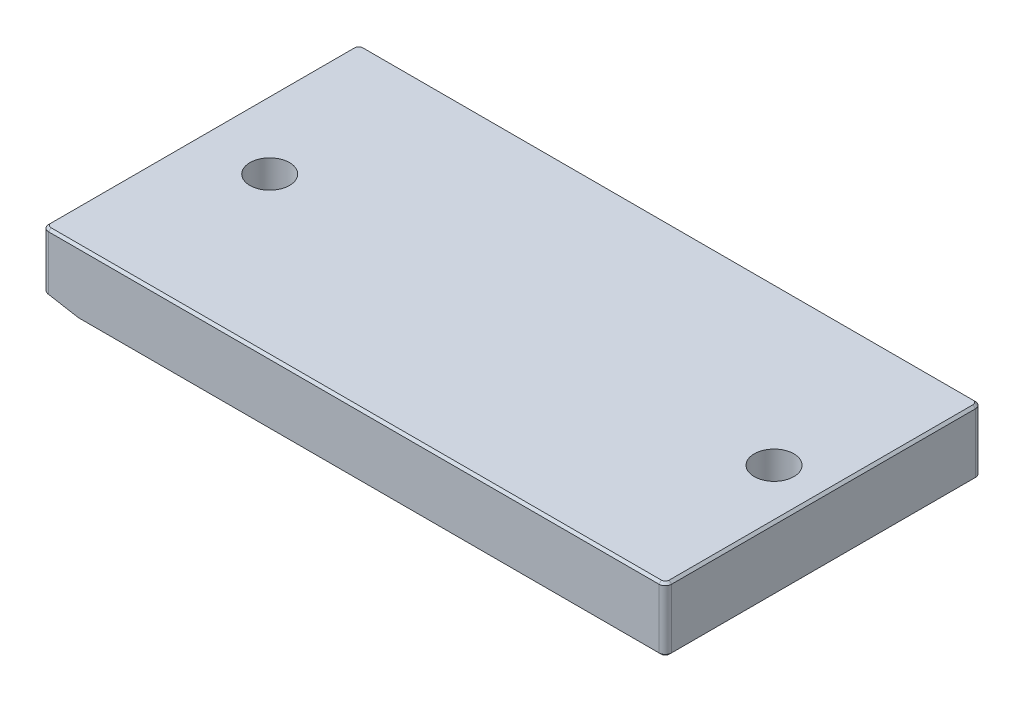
ISO-10303-21;
HEADER;
FILE_DESCRIPTION(('STEP AP214'),'2;1');
FILE_NAME('part.step','',(''),(''),'','','');
FILE_SCHEMA(('AUTOMOTIVE_DESIGN { 1 0 10303 214 1 1 1 1 }'));
ENDSEC;
DATA;
#1=APPLICATION_CONTEXT('core data for automotive mechanical design processes');
#2=APPLICATION_PROTOCOL_DEFINITION('international standard','automotive_design',2000,#1);
#3=PRODUCT_CONTEXT('',#1,'mechanical');
#4=PRODUCT('Part','Part','',(#3));
#5=PRODUCT_RELATED_PRODUCT_CATEGORY('part','',(#4));
#6=PRODUCT_DEFINITION_FORMATION('','',#4);
#7=PRODUCT_DEFINITION_CONTEXT('part definition',#1,'design');
#8=PRODUCT_DEFINITION('design','',#6,#7);
#9=PRODUCT_DEFINITION_SHAPE('','',#8);
#10=(LENGTH_UNIT() NAMED_UNIT(*) SI_UNIT(.MILLI.,.METRE.));
#11=(NAMED_UNIT(*) PLANE_ANGLE_UNIT() SI_UNIT($,.RADIAN.));
#12=(NAMED_UNIT(*) SI_UNIT($,.STERADIAN.) SOLID_ANGLE_UNIT());
#13=UNCERTAINTY_MEASURE_WITH_UNIT(LENGTH_MEASURE(1.E-05),#10,'distance_accuracy_value','');
#14=(GEOMETRIC_REPRESENTATION_CONTEXT(3) GLOBAL_UNCERTAINTY_ASSIGNED_CONTEXT((#13)) GLOBAL_UNIT_ASSIGNED_CONTEXT((#10,
#11,#12)) REPRESENTATION_CONTEXT('',''));
#15=CARTESIAN_POINT('',(0.,0.,0.));
#16=DIRECTION('',(0.,0.,1.));
#17=DIRECTION('',(1.,0.,0.));
#18=AXIS2_PLACEMENT_3D('',#15,#16,#17);
#19=CARTESIAN_POINT('',(-98.425,20.6248,-50.8));
#20=DIRECTION('',(0.,0.,1.));
#21=DIRECTION('',(1.,0.,0.));
#22=AXIS2_PLACEMENT_3D('',#19,#20,#21);
#23=PLANE('',#22);
#24=DIRECTION('',(-1.,0.,0.));
#25=VECTOR('',#24,1.);
#26=CARTESIAN_POINT('',(-98.425,0.762000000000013,-50.8));
#27=LINE('',#26,#25);
#28=CARTESIAN_POINT('',(99.568,0.762000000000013,-50.8));
#29=VERTEX_POINT('',#28);
#30=CARTESIAN_POINT('',(-86.8275417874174,0.762000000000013,-50.8));
#31=VERTEX_POINT('',#30);
#32=EDGE_CURVE('E823',#29,#31,#27,.T.);
#33=ORIENTED_EDGE('',*,*,#32,.T.);
#34=DIRECTION('',(-0.984807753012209,0.173648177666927,0.));
#35=VECTOR('',#34,1.);
#36=CARTESIAN_POINT('',(-96.2040275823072,2.41532742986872,-50.8));
#37=LINE('',#36,#35);
#38=CARTESIAN_POINT('',(-96.393,2.44864836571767,-50.8));
#39=VERTEX_POINT('',#38);
#40=EDGE_CURVE('E822',#31,#39,#37,.T.);
#41=ORIENTED_EDGE('',*,*,#40,.T.);
#42=DIRECTION('',(0.,-1.,0.));
#43=VECTOR('',#42,1.);
#44=CARTESIAN_POINT('',(-96.393,20.6248,-50.8));
#45=LINE('',#44,#43);
#46=CARTESIAN_POINT('',(-96.393,19.8628,-50.8));
#47=VERTEX_POINT('',#46);
#48=EDGE_CURVE('E815',#39,#47,#45,.F.);
#49=ORIENTED_EDGE('',*,*,#48,.T.);
#50=DIRECTION('',(1.,0.,0.));
#51=VECTOR('',#50,1.);
#52=CARTESIAN_POINT('',(99.5679999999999,19.8628,-50.8));
#53=LINE('',#52,#51);
#54=CARTESIAN_POINT('',(99.568,19.8628,-50.8));
#55=VERTEX_POINT('',#54);
#56=EDGE_CURVE('E826',#47,#55,#53,.T.);
#57=ORIENTED_EDGE('',*,*,#56,.T.);
#58=DIRECTION('',(0.,-1.,0.));
#59=VECTOR('',#58,1.);
#60=CARTESIAN_POINT('',(99.568,20.6248,-50.8));
#61=LINE('',#60,#59);
#62=EDGE_CURVE('E817',#55,#29,#61,.T.);
#63=ORIENTED_EDGE('',*,*,#62,.T.);
#64=EDGE_LOOP('',(#33,#41,#49,#57,#63));
#65=FACE_BOUND('',#64,.T.);
#66=CARTESIAN_POINT('',(-92.8011851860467,13.6342831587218,-50.8));
#67=CARTESIAN_POINT('',(-92.7636238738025,13.6349177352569,-50.8));
#68=CARTESIAN_POINT('',(-92.6895602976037,13.6361689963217,-50.8));
#69=CARTESIAN_POINT('',(-92.5798153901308,13.6491144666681,-50.8));
#70=CARTESIAN_POINT('',(-92.4732953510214,13.6699272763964,-50.8));
#71=CARTESIAN_POINT('',(-92.3694745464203,13.6990691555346,-50.8));
#72=CARTESIAN_POINT('',(-92.2678203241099,13.7347400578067,-50.8));
#73=CARTESIAN_POINT('',(-92.1697178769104,13.781213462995,-50.8));
#74=CARTESIAN_POINT('',(-92.0740764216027,13.8347358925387,-50.8));
#75=CARTESIAN_POINT('',(-91.9811511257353,13.8956896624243,-50.8));
#76=CARTESIAN_POINT('',(-91.8926881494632,13.965523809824,-50.8));
#77=CARTESIAN_POINT('',(-91.8081896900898,14.0427637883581,-50.8));
#78=CARTESIAN_POINT('',(-91.72977850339,14.1293370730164,-50.8));
#79=CARTESIAN_POINT('',(-91.6567978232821,14.2238766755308,-50.8));
#80=CARTESIAN_POINT('',(-91.5874366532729,14.3255128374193,-50.8));
#81=CARTESIAN_POINT('',(-91.5236336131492,14.4356332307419,-50.8));
#82=CARTESIAN_POINT('',(-91.4646182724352,14.5538012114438,-50.8));
#83=CARTESIAN_POINT('',(-91.4106748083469,14.6807802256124,-50.8));
#84=CARTESIAN_POINT('',(-91.3628475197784,14.8184231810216,-50.8));
#85=CARTESIAN_POINT('',(-91.3206004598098,14.9683047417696,-50.8));
#86=CARTESIAN_POINT('',(-91.287243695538,15.1317478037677,-50.8));
#87=CARTESIAN_POINT('',(-91.2586918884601,15.3074396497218,-50.8));
#88=CARTESIAN_POINT('',(-91.2356626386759,15.496135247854,-50.8));
#89=CARTESIAN_POINT('',(-91.2199405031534,15.6979370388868,-50.8));
#90=CARTESIAN_POINT('',(-91.2102232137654,15.9127192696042,-50.8));
#91=CARTESIAN_POINT('',(-91.2093590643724,16.0600434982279,-50.8));
#92=CARTESIAN_POINT('',(-91.2089150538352,16.1357404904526,-50.8));
#93=B_SPLINE_CURVE_WITH_KNOTS('',3,(#66,#67,#68,#69,#70,#71,#72,#73,#74,#75,#76,#77,#78,#79,#80,
#81,#82,#83,#84,#85,#86,#87,#88,#89,#90,#91,#92),.UNSPECIFIED.,.F.,.F.,(4,1,1,1,1,1,1,1,1,1,1,1,
1,1,1,1,1,1,1,1,1,1,1,1,4),(0.,0.0337871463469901,0.0666216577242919,0.0992848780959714,
0.131361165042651,0.163585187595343,0.196103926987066,0.228902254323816,0.262158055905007,
0.295991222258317,0.330217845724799,0.365059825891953,0.400950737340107,0.437620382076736,
0.475707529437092,0.515380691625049,0.556413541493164,0.599764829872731,0.646424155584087,
0.696431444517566,0.749781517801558,0.806573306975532,0.867435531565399,0.931886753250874,1.),.UNSPECIFIED.);
#94=CARTESIAN_POINT('',(-92.8011851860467,13.6342831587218,-50.8));
#95=VERTEX_POINT('',#94);
#96=CARTESIAN_POINT('',(-91.2089150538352,16.1357404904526,-50.8));
#97=VERTEX_POINT('',#96);
#98=EDGE_CURVE('E53',#95,#97,#93,.T.);
#99=ORIENTED_EDGE('',*,*,#98,.T.);
#100=CARTESIAN_POINT('',(-91.2089150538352,16.1357404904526,-50.8));
#101=CARTESIAN_POINT('',(-91.209361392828,16.2120730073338,-50.8));
#102=CARTESIAN_POINT('',(-91.210228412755,16.3603500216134,-50.8));
#103=CARTESIAN_POINT('',(-91.2198737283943,16.5764105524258,-50.8));
#104=CARTESIAN_POINT('',(-91.235896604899,16.7791029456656,-50.8));
#105=CARTESIAN_POINT('',(-91.2578549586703,16.9684369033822,-50.8));
#106=CARTESIAN_POINT('',(-91.2845766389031,17.1444613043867,-50.8));
#107=CARTESIAN_POINT('',(-91.3202484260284,17.3067057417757,-50.8));
#108=CARTESIAN_POINT('',(-91.3608151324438,17.4559211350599,-50.8));
#109=CARTESIAN_POINT('',(-91.4078311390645,17.5925940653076,-50.8));
#110=CARTESIAN_POINT('',(-91.4608823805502,17.7185658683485,-50.8));
#111=CARTESIAN_POINT('',(-91.5186232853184,17.8361658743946,-50.8));
#112=CARTESIAN_POINT('',(-91.5833453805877,17.9452161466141,-50.8));
#113=CARTESIAN_POINT('',(-91.6513496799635,18.0474572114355,-50.8));
#114=CARTESIAN_POINT('',(-91.7253889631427,18.141215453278,-50.8));
#115=CARTESIAN_POINT('',(-91.8033562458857,18.2278149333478,-50.8));
#116=CARTESIAN_POINT('',(-91.8882945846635,18.3052542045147,-50.8));
#117=CARTESIAN_POINT('',(-91.9773166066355,18.3758022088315,-50.8));
#118=CARTESIAN_POINT('',(-92.0712282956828,18.4376459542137,-50.8));
#119=CARTESIAN_POINT('',(-92.1673527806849,18.4921190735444,-50.8));
#120=CARTESIAN_POINT('',(-92.2663516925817,18.5386553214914,-50.8));
#121=CARTESIAN_POINT('',(-92.368495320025,18.5752455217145,-50.8));
#122=CARTESIAN_POINT('',(-92.4728655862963,18.6054681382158,-50.8));
#123=CARTESIAN_POINT('',(-92.5798273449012,18.6261359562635,-50.8));
#124=CARTESIAN_POINT('',(-92.6895572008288,18.6391401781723,-50.8));
#125=CARTESIAN_POINT('',(-92.7636228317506,18.6403834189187,-50.8));
#126=CARTESIAN_POINT('',(-92.8011851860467,18.6410139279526,-50.8));
#127=B_SPLINE_CURVE_WITH_KNOTS('',3,(#100,#101,#102,#103,#104,#105,#106,#107,#108,#109,#110,
#111,#112,#113,#114,#115,#116,#117,#118,#119,#120,#121,#122,#123,#124,#125,#126),.UNSPECIFIED.,
.F.,.F.,(4,1,1,1,1,1,1,1,1,1,1,1,1,1,1,1,1,1,1,1,1,1,1,1,4),(0.,0.0685946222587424,
0.133246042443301,0.194312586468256,0.251279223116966,0.304513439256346,0.354234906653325,
0.400480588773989,0.443410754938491,0.484014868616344,0.523252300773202,0.561042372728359,
0.5979002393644,0.633518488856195,0.66831435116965,0.702495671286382,0.736685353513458,
0.770293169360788,0.803437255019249,0.835912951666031,0.868460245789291,0.900846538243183,
0.93346652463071,0.966257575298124,1.),.UNSPECIFIED.);
#128=CARTESIAN_POINT('',(-92.8011851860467,18.6410139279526,-50.8));
#129=VERTEX_POINT('',#128);
#130=EDGE_CURVE('E299',#97,#129,#127,.T.);
#131=ORIENTED_EDGE('',*,*,#130,.T.);
#132=CARTESIAN_POINT('',(-92.8011851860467,18.6410139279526,-50.8));
#133=CARTESIAN_POINT('',(-92.8390613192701,18.6403501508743,-50.8));
#134=CARTESIAN_POINT('',(-92.9143850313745,18.6390301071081,-50.8));
#135=CARTESIAN_POINT('',(-93.0257463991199,18.6263428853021,-50.8));
#136=CARTESIAN_POINT('',(-93.1345350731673,18.605291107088,-50.8));
#137=CARTESIAN_POINT('',(-93.2402872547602,18.5754629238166,-50.8));
#138=CARTESIAN_POINT('',(-93.3438716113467,18.5384573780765,-50.8));
#139=CARTESIAN_POINT('',(-93.4444779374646,18.4920745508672,-50.8));
#140=CARTESIAN_POINT('',(-93.5427311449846,18.4380829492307,-50.8));
#141=CARTESIAN_POINT('',(-93.6370698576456,18.3746411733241,-50.8));
#142=CARTESIAN_POINT('',(-93.7285297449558,18.3039081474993,-50.8));
#143=CARTESIAN_POINT('',(-93.8148642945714,18.2239489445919,-50.8));
#144=CARTESIAN_POINT('',(-93.8960813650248,18.1355709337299,-50.8));
#145=CARTESIAN_POINT('',(-93.973200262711,18.039719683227,-50.8));
#146=CARTESIAN_POINT('',(-94.0440330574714,17.9345567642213,-50.8));
#147=CARTESIAN_POINT('',(-94.111488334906,17.8219112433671,-50.8));
#148=CARTESIAN_POINT('',(-94.1718659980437,17.6998131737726,-50.8));
#149=CARTESIAN_POINT('',(-94.2300156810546,17.5702997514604,-50.8));
#150=CARTESIAN_POINT('',(-94.2802083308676,17.429787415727,-50.8));
#151=CARTESIAN_POINT('',(-94.3254741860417,17.2790682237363,-50.8));
#152=CARTESIAN_POINT('',(-94.3620487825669,17.1163619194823,-50.8));
#153=CARTESIAN_POINT('',(-94.3925141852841,16.94252217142,-50.8));
#154=CARTESIAN_POINT('',(-94.4161156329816,16.7569105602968,-50.8));
#155=CARTESIAN_POINT('',(-94.4333050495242,16.5599249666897,-50.8));
#156=CARTESIAN_POINT('',(-94.4423852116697,16.3514357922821,-50.8));
#157=CARTESIAN_POINT('',(-94.4440952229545,16.2088902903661,-50.8));
#158=CARTESIAN_POINT('',(-94.4449727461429,16.1357404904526,-50.8));
#159=B_SPLINE_CURVE_WITH_KNOTS('',3,(#132,#133,#134,#135,#136,#137,#138,#139,#140,#141,#142,
#143,#144,#145,#146,#147,#148,#149,#150,#151,#152,#153,#154,#155,#156,#157,#158),.UNSPECIFIED.,
.F.,.F.,(4,1,1,1,1,1,1,1,1,1,1,1,1,1,1,1,1,1,1,1,1,1,1,1,4),(0.,0.0337881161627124,
0.067193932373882,0.0998624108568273,0.132566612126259,0.165151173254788,0.197913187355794,
0.231319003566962,0.265083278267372,0.299255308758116,0.334398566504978,0.369942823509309,
0.40628356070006,0.444063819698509,0.482997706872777,0.523354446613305,0.565536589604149,
0.609612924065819,0.656390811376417,0.705885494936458,0.758324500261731,0.81383178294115,
0.87279455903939,0.934722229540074,1.),.UNSPECIFIED.);
#160=CARTESIAN_POINT('',(-94.4449727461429,16.1357404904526,-50.8));
#161=VERTEX_POINT('',#160);
#162=EDGE_CURVE('E307',#129,#161,#159,.T.);
#163=ORIENTED_EDGE('',*,*,#162,.T.);
#164=CARTESIAN_POINT('',(-94.4449727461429,16.1357404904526,-50.8));
#165=CARTESIAN_POINT('',(-94.4440861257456,16.0629097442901,-50.8));
#166=CARTESIAN_POINT('',(-94.4423585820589,15.9210020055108,-50.8));
#167=CARTESIAN_POINT('',(-94.4334068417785,15.7134509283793,-50.8));
#168=CARTESIAN_POINT('',(-94.4157738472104,15.517510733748,-50.8));
#169=CARTESIAN_POINT('',(-94.3937166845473,15.332711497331,-50.8));
#170=CARTESIAN_POINT('',(-94.3631673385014,15.1598223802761,-50.8));
#171=CARTESIAN_POINT('',(-94.3256045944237,14.9982451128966,-50.8));
#172=CARTESIAN_POINT('',(-94.2838982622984,14.8472819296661,-50.8));
#173=CARTESIAN_POINT('',(-94.2324159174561,14.7081695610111,-50.8));
#174=CARTESIAN_POINT('',(-94.1760677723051,14.5789673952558,-50.8));
#175=CARTESIAN_POINT('',(-94.1147605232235,14.45831673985,-50.8));
#176=CARTESIAN_POINT('',(-94.0490790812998,14.345151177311,-50.8));
#177=CARTESIAN_POINT('',(-93.9775208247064,14.2403765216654,-50.8));
#178=CARTESIAN_POINT('',(-93.901248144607,14.1432505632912,-50.8));
#179=CARTESIAN_POINT('',(-93.8186285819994,14.0554877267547,-50.8));
#180=CARTESIAN_POINT('',(-93.7319911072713,13.9749733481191,-50.8));
#181=CARTESIAN_POINT('',(-93.6402620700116,13.9033295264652,-50.8));
#182=CARTESIAN_POINT('',(-93.5444520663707,13.8406212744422,-50.8));
#183=CARTESIAN_POINT('',(-93.4465363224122,13.7845409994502,-50.8));
#184=CARTESIAN_POINT('',(-93.3447775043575,13.7393207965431,-50.8));
#185=CARTESIAN_POINT('',(-93.2414816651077,13.7004927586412,-50.8));
#186=CARTESIAN_POINT('',(-93.1351712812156,13.6708285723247,-50.8));
#187=CARTESIAN_POINT('',(-93.0259788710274,13.650317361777,-50.8));
#188=CARTESIAN_POINT('',(-92.9144598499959,13.6359320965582,-50.8));
#189=CARTESIAN_POINT('',(-92.8390741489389,13.6348347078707,-50.8));
#190=CARTESIAN_POINT('',(-92.8011851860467,13.6342831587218,-50.8));
#191=B_SPLINE_CURVE_WITH_KNOTS('',3,(#164,#165,#166,#167,#168,#169,#170,#171,#172,#173,#174,
#175,#176,#177,#178,#179,#180,#181,#182,#183,#184,#185,#186,#187,#188,#189,#190),.UNSPECIFIED.,
.F.,.F.,(4,1,1,1,1,1,1,1,1,1,1,1,1,1,1,1,1,1,1,1,1,1,1,1,4),(0.,0.0650632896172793,
0.126773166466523,0.185515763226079,0.240764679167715,0.292979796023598,0.342250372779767,
0.38891928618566,0.43277566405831,0.474628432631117,0.514774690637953,0.553605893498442,
0.591426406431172,0.628028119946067,0.663803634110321,0.698984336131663,0.733591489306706,
0.767628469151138,0.801208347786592,0.834263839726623,0.866980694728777,0.899719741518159,
0.932701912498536,0.966175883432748,1.),.UNSPECIFIED.);
#192=EDGE_CURVE('E315',#161,#95,#191,.T.);
#193=ORIENTED_EDGE('',*,*,#192,.T.);
#194=EDGE_LOOP('',(#99,#131,#163,#193));
#195=FACE_BOUND('',#194,.T.);
#196=ADVANCED_FACE('F34',(#65,#195),#23,.F.);
#197=CARTESIAN_POINT('',(0.,0.,0.));
#198=DIRECTION('',(0.,1.,0.));
#199=DIRECTION('',(0.,0.,1.));
#200=AXIS2_PLACEMENT_3D('',#197,#198,#199);
#201=PLANE('',#200);
#202=CARTESIAN_POINT('',(85.725,0.,0.));
#203=DIRECTION('',(0.,-1.,0.));
#204=DIRECTION('',(0.,0.,-1.));
#205=AXIS2_PLACEMENT_3D('',#202,#203,#204);
#206=CIRCLE('',#205,10.3124);
#207=CARTESIAN_POINT('',(85.725,0.,-10.3124));
#208=VERTEX_POINT('',#207);
#209=EDGE_CURVE('E348',#208,#208,#206,.T.);
#210=ORIENTED_EDGE('',*,*,#209,.F.);
#211=EDGE_LOOP('',(#210));
#212=FACE_BOUND('',#211,.T.);
#213=DIRECTION('',(-1.,0.,0.));
#214=VECTOR('',#213,1.);
#215=CARTESIAN_POINT('',(0.,0.,50.038));
#216=LINE('',#215,#214);
#217=CARTESIAN_POINT('',(99.568,0.,50.038));
#218=VERTEX_POINT('',#217);
#219=CARTESIAN_POINT('',(-87.5895417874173,0.,50.038));
#220=VERTEX_POINT('',#219);
#221=EDGE_CURVE('E884',#218,#220,#216,.T.);
#222=ORIENTED_EDGE('',*,*,#221,.T.);
#223=DIRECTION('',(0.988951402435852,0.,0.148240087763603));
#224=VECTOR('',#223,1.);
#225=CARTESIAN_POINT('',(-101.055252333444,0.,48.0195407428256));
#226=LINE('',#225,#224);
#227=CARTESIAN_POINT('',(-88.7729999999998,0.,49.860604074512));
#228=VERTEX_POINT('',#227);
#229=EDGE_CURVE('E832',#220,#228,#226,.F.);
#230=ORIENTED_EDGE('',*,*,#229,.T.);
#231=DIRECTION('',(0.,0.,-1.));
#232=VECTOR('',#231,1.);
#233=CARTESIAN_POINT('',(-88.7729999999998,0.,0.));
#234=LINE('',#233,#232);
#235=CARTESIAN_POINT('',(-88.7729999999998,0.,-49.860604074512));
#236=VERTEX_POINT('',#235);
#237=EDGE_CURVE('E360',#228,#236,#234,.T.);
#238=ORIENTED_EDGE('',*,*,#237,.T.);
#239=DIRECTION('',(-0.988951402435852,0.,0.148240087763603));
#240=VECTOR('',#239,1.);
#241=CARTESIAN_POINT('',(-101.055252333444,0.,-48.0195407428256));
#242=LINE('',#241,#240);
#243=CARTESIAN_POINT('',(-87.5895417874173,0.,-50.038));
#244=VERTEX_POINT('',#243);
#245=EDGE_CURVE('E874',#236,#244,#242,.F.);
#246=ORIENTED_EDGE('',*,*,#245,.T.);
#247=DIRECTION('',(1.,0.,0.));
#248=VECTOR('',#247,1.);
#249=CARTESIAN_POINT('',(0.,0.,-50.038));
#250=LINE('',#249,#248);
#251=CARTESIAN_POINT('',(99.568,0.,-50.038));
#252=VERTEX_POINT('',#251);
#253=EDGE_CURVE('E852',#244,#252,#250,.T.);
#254=ORIENTED_EDGE('',*,*,#253,.T.);
#255=CARTESIAN_POINT('',(99.568,0.,-48.768));
#256=DIRECTION('',(0.,1.,0.));
#257=DIRECTION('',(0.,0.,1.));
#258=AXIS2_PLACEMENT_3D('',#255,#256,#257);
#259=CIRCLE('',#258,1.26999999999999);
#260=CARTESIAN_POINT('',(100.838,0.,-48.768));
#261=VERTEX_POINT('',#260);
#262=EDGE_CURVE('E870',#252,#261,#259,.F.);
#263=ORIENTED_EDGE('',*,*,#262,.T.);
#264=DIRECTION('',(0.,0.,1.));
#265=VECTOR('',#264,1.);
#266=CARTESIAN_POINT('',(100.838,0.,0.));
#267=LINE('',#266,#265);
#268=CARTESIAN_POINT('',(100.838,0.,48.768));
#269=VERTEX_POINT('',#268);
#270=EDGE_CURVE('E876',#261,#269,#267,.T.);
#271=ORIENTED_EDGE('',*,*,#270,.T.);
#272=CARTESIAN_POINT('',(99.568,0.,48.768));
#273=DIRECTION('',(0.,1.,0.));
#274=DIRECTION('',(0.,0.,1.));
#275=AXIS2_PLACEMENT_3D('',#272,#273,#274);
#276=CIRCLE('',#275,1.26999999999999);
#277=EDGE_CURVE('E879',#269,#218,#276,.F.);
#278=ORIENTED_EDGE('',*,*,#277,.T.);
#279=EDGE_LOOP('',(#222,#230,#238,#246,#254,#263,#271,#278));
#280=FACE_BOUND('',#279,.T.);
#281=CARTESIAN_POINT('',(-76.2,0.,0.));
#282=DIRECTION('',(0.,-1.,0.));
#283=DIRECTION('',(0.,0.,-1.));
#284=AXIS2_PLACEMENT_3D('',#281,#282,#283);
#285=CIRCLE('',#284,10.3124);
#286=CARTESIAN_POINT('',(-76.2,0.,-10.3124));
#287=VERTEX_POINT('',#286);
#288=EDGE_CURVE('E335',#287,#287,#285,.T.);
#289=ORIENTED_EDGE('',*,*,#288,.F.);
#290=EDGE_LOOP('',(#289));
#291=FACE_BOUND('',#290,.T.);
#292=ADVANCED_FACE('F667',(#212,#280,#291),#201,.F.);
#293=CARTESIAN_POINT('',(0.,20.6248,0.));
#294=DIRECTION('',(0.,1.,0.));
#295=DIRECTION('',(0.,0.,1.));
#296=AXIS2_PLACEMENT_3D('',#293,#294,#295);
#297=PLANE('',#296);
#298=CARTESIAN_POINT('',(-96.393,20.6248,48.768));
#299=DIRECTION('',(0.,1.,0.));
#300=DIRECTION('',(0.,0.,1.));
#301=AXIS2_PLACEMENT_3D('',#298,#299,#300);
#302=CIRCLE('',#301,1.26999999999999);
#303=CARTESIAN_POINT('',(-97.6630000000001,20.6248,48.768));
#304=VERTEX_POINT('',#303);
#305=CARTESIAN_POINT('',(-96.393,20.6248,50.038));
#306=VERTEX_POINT('',#305);
#307=EDGE_CURVE('E407',#304,#306,#302,.T.);
#308=ORIENTED_EDGE('',*,*,#307,.T.);
#309=DIRECTION('',(1.,0.,0.));
#310=VECTOR('',#309,1.);
#311=CARTESIAN_POINT('',(99.568,20.6248,50.038));
#312=LINE('',#311,#310);
#313=CARTESIAN_POINT('',(99.568,20.6248,50.038));
#314=VERTEX_POINT('',#313);
#315=EDGE_CURVE('E377',#306,#314,#312,.T.);
#316=ORIENTED_EDGE('',*,*,#315,.T.);
#317=CARTESIAN_POINT('',(99.568,20.6248,48.768));
#318=DIRECTION('',(0.,1.,0.));
#319=DIRECTION('',(0.,0.,1.));
#320=AXIS2_PLACEMENT_3D('',#317,#318,#319);
#321=CIRCLE('',#320,1.26999999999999);
#322=CARTESIAN_POINT('',(100.838,20.6248,48.768));
#323=VERTEX_POINT('',#322);
#324=EDGE_CURVE('E409',#314,#323,#321,.T.);
#325=ORIENTED_EDGE('',*,*,#324,.T.);
#326=DIRECTION('',(0.,0.,-1.));
#327=VECTOR('',#326,1.);
#328=CARTESIAN_POINT('',(100.838,20.6248,-48.768));
#329=LINE('',#328,#327);
#330=CARTESIAN_POINT('',(100.838,20.6248,-48.768));
#331=VERTEX_POINT('',#330);
#332=EDGE_CURVE('E402',#323,#331,#329,.T.);
#333=ORIENTED_EDGE('',*,*,#332,.T.);
#334=CARTESIAN_POINT('',(99.568,20.6248,-48.768));
#335=DIRECTION('',(0.,1.,0.));
#336=DIRECTION('',(0.,0.,1.));
#337=AXIS2_PLACEMENT_3D('',#334,#335,#336);
#338=CIRCLE('',#337,1.26999999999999);
#339=CARTESIAN_POINT('',(99.568,20.6248,-50.038));
#340=VERTEX_POINT('',#339);
#341=EDGE_CURVE('E400',#331,#340,#338,.T.);
#342=ORIENTED_EDGE('',*,*,#341,.T.);
#343=DIRECTION('',(-1.,0.,0.));
#344=VECTOR('',#343,1.);
#345=CARTESIAN_POINT('',(-96.393,20.6248,-50.038));
#346=LINE('',#345,#344);
#347=CARTESIAN_POINT('',(-96.393,20.6248,-50.038));
#348=VERTEX_POINT('',#347);
#349=EDGE_CURVE('E396',#340,#348,#346,.T.);
#350=ORIENTED_EDGE('',*,*,#349,.T.);
#351=CARTESIAN_POINT('',(-96.393,20.6248,-48.768));
#352=DIRECTION('',(0.,1.,0.));
#353=DIRECTION('',(0.,0.,1.));
#354=AXIS2_PLACEMENT_3D('',#351,#352,#353);
#355=CIRCLE('',#354,1.26999999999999);
#356=CARTESIAN_POINT('',(-97.663,20.6248,-48.768));
#357=VERTEX_POINT('',#356);
#358=EDGE_CURVE('E398',#348,#357,#355,.T.);
#359=ORIENTED_EDGE('',*,*,#358,.T.);
#360=DIRECTION('',(0.,0.,1.));
#361=VECTOR('',#360,1.);
#362=CARTESIAN_POINT('',(-97.6630000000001,20.6248,48.768));
#363=LINE('',#362,#361);
#364=EDGE_CURVE('E404',#357,#304,#363,.T.);
#365=ORIENTED_EDGE('',*,*,#364,.T.);
#366=EDGE_LOOP('',(#308,#316,#325,#333,#342,#350,#359,#365));
#367=FACE_BOUND('',#366,.T.);
#368=CARTESIAN_POINT('',(85.725,20.6248,0.));
#369=DIRECTION('',(0.,-1.,0.));
#370=DIRECTION('',(0.,0.,-1.));
#371=AXIS2_PLACEMENT_3D('',#368,#369,#370);
#372=CIRCLE('',#371,6.3627);
#373=CARTESIAN_POINT('',(85.725,20.6248,-6.3627));
#374=VERTEX_POINT('',#373);
#375=EDGE_CURVE('E357',#374,#374,#372,.T.);
#376=ORIENTED_EDGE('',*,*,#375,.T.);
#377=EDGE_LOOP('',(#376));
#378=FACE_BOUND('',#377,.T.);
#379=CARTESIAN_POINT('',(-76.2,20.6248,0.));
#380=DIRECTION('',(0.,-1.,0.));
#381=DIRECTION('',(0.,0.,-1.));
#382=AXIS2_PLACEMENT_3D('',#379,#380,#381);
#383=CIRCLE('',#382,6.3627);
#384=CARTESIAN_POINT('',(-76.2,20.6248,-6.3627));
#385=VERTEX_POINT('',#384);
#386=EDGE_CURVE('E345',#385,#385,#383,.T.);
#387=ORIENTED_EDGE('',*,*,#386,.T.);
#388=EDGE_LOOP('',(#387));
#389=FACE_BOUND('',#388,.T.);
#390=ADVANCED_FACE('F413',(#367,#378,#389),#297,.T.);
#391=CARTESIAN_POINT('',(-98.425,20.6248,-50.8));
#392=DIRECTION('',(1.,0.,0.));
#393=DIRECTION('',(0.,0.,-1.));
#394=AXIS2_PLACEMENT_3D('',#391,#392,#393);
#395=PLANE('',#394);
#396=DIRECTION('',(0.,-1.,0.));
#397=VECTOR('',#396,1.);
#398=CARTESIAN_POINT('',(-98.425,20.6248,48.768));
#399=LINE('',#398,#397);
#400=CARTESIAN_POINT('',(-98.425,2.64130394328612,48.768));
#401=VERTEX_POINT('',#400);
#402=CARTESIAN_POINT('',(-98.425,19.8628,48.768));
#403=VERTEX_POINT('',#402);
#404=EDGE_CURVE('E363',#401,#403,#399,.F.);
#405=ORIENTED_EDGE('',*,*,#404,.T.);
#406=DIRECTION('',(0.,0.,-1.));
#407=VECTOR('',#406,1.);
#408=CARTESIAN_POINT('',(-98.425,19.8628,-48.768));
#409=LINE('',#408,#407);
#410=CARTESIAN_POINT('',(-98.425,19.8628,-48.768));
#411=VERTEX_POINT('',#410);
#412=EDGE_CURVE('E376',#403,#411,#409,.T.);
#413=ORIENTED_EDGE('',*,*,#412,.T.);
#414=DIRECTION('',(0.,-1.,0.));
#415=VECTOR('',#414,1.);
#416=CARTESIAN_POINT('',(-98.425,20.6248,-48.768));
#417=LINE('',#416,#415);
#418=CARTESIAN_POINT('',(-98.425,2.64130394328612,-48.768));
#419=VERTEX_POINT('',#418);
#420=EDGE_CURVE('E372',#411,#419,#417,.T.);
#421=ORIENTED_EDGE('',*,*,#420,.T.);
#422=DIRECTION('',(0.,0.,1.));
#423=VECTOR('',#422,1.);
#424=CARTESIAN_POINT('',(-98.425,2.64130394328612,48.768));
#425=LINE('',#424,#423);
#426=EDGE_CURVE('E374',#419,#401,#425,.T.);
#427=ORIENTED_EDGE('',*,*,#426,.T.);
#428=EDGE_LOOP('',(#405,#413,#421,#427));
#429=FACE_BOUND('',#428,.T.);
#430=ADVANCED_FACE('F770',(#429),#395,.F.);
#431=CARTESIAN_POINT('',(-98.425,20.6248,50.8));
#432=DIRECTION('',(0.,0.,-1.));
#433=DIRECTION('',(-1.,0.,0.));
#434=AXIS2_PLACEMENT_3D('',#431,#432,#433);
#435=PLANE('',#434);
#436=DIRECTION('',(0.,-1.,0.));
#437=VECTOR('',#436,1.);
#438=CARTESIAN_POINT('',(99.568,20.6248,50.8));
#439=LINE('',#438,#437);
#440=CARTESIAN_POINT('',(99.568,0.762000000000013,50.8));
#441=VERTEX_POINT('',#440);
#442=CARTESIAN_POINT('',(99.568,19.8628,50.8));
#443=VERTEX_POINT('',#442);
#444=EDGE_CURVE('E387',#441,#443,#439,.F.);
#445=ORIENTED_EDGE('',*,*,#444,.T.);
#446=DIRECTION('',(-1.,0.,0.));
#447=VECTOR('',#446,1.);
#448=CARTESIAN_POINT('',(-96.393,19.8628,50.8));
#449=LINE('',#448,#447);
#450=CARTESIAN_POINT('',(-96.393,19.8628,50.8));
#451=VERTEX_POINT('',#450);
#452=EDGE_CURVE('E431',#443,#451,#449,.T.);
#453=ORIENTED_EDGE('',*,*,#452,.T.);
#454=DIRECTION('',(0.,-1.,0.));
#455=VECTOR('',#454,1.);
#456=CARTESIAN_POINT('',(-96.393,20.6248,50.8));
#457=LINE('',#456,#455);
#458=CARTESIAN_POINT('',(-96.393,2.44864836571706,50.8));
#459=VERTEX_POINT('',#458);
#460=EDGE_CURVE('E383',#451,#459,#457,.T.);
#461=ORIENTED_EDGE('',*,*,#460,.T.);
#462=DIRECTION('',(0.984807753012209,-0.173648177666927,0.));
#463=VECTOR('',#462,1.);
#464=CARTESIAN_POINT('',(-88.5840275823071,1.07171583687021,50.8));
#465=LINE('',#464,#463);
#466=CARTESIAN_POINT('',(-86.8275417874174,0.762000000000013,50.8));
#467=VERTEX_POINT('',#466);
#468=EDGE_CURVE('E382',#459,#467,#465,.T.);
#469=ORIENTED_EDGE('',*,*,#468,.T.);
#470=DIRECTION('',(1.,0.,0.));
#471=VECTOR('',#470,1.);
#472=CARTESIAN_POINT('',(-98.425,0.762000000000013,50.8));
#473=LINE('',#472,#471);
#474=EDGE_CURVE('E889',#467,#441,#473,.T.);
#475=ORIENTED_EDGE('',*,*,#474,.T.);
#476=EDGE_LOOP('',(#445,#453,#461,#469,#475));
#477=FACE_BOUND('',#476,.T.);
#478=ADVANCED_FACE('F774',(#477),#435,.F.);
#479=CARTESIAN_POINT('',(101.6,20.6248,-50.8));
#480=DIRECTION('',(-1.,0.,0.));
#481=DIRECTION('',(0.,0.,1.));
#482=AXIS2_PLACEMENT_3D('',#479,#480,#481);
#483=PLANE('',#482);
#484=DIRECTION('',(0.,-1.,0.));
#485=VECTOR('',#484,1.);
#486=CARTESIAN_POINT('',(101.6,20.6248,-48.768));
#487=LINE('',#486,#485);
#488=CARTESIAN_POINT('',(101.6,0.762000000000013,-48.768));
#489=VERTEX_POINT('',#488);
#490=CARTESIAN_POINT('',(101.6,19.8628,-48.768));
#491=VERTEX_POINT('',#490);
#492=EDGE_CURVE('E388',#489,#491,#487,.F.);
#493=ORIENTED_EDGE('',*,*,#492,.T.);
#494=DIRECTION('',(0.,0.,1.));
#495=VECTOR('',#494,1.);
#496=CARTESIAN_POINT('',(101.6,19.8628,48.768));
#497=LINE('',#496,#495);
#498=CARTESIAN_POINT('',(101.6,19.8628,48.768));
#499=VERTEX_POINT('',#498);
#500=EDGE_CURVE('E846',#491,#499,#497,.T.);
#501=ORIENTED_EDGE('',*,*,#500,.T.);
#502=DIRECTION('',(0.,-1.,0.));
#503=VECTOR('',#502,1.);
#504=CARTESIAN_POINT('',(101.6,20.6248,48.768));
#505=LINE('',#504,#503);
#506=CARTESIAN_POINT('',(101.6,0.762000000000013,48.768));
#507=VERTEX_POINT('',#506);
#508=EDGE_CURVE('E835',#499,#507,#505,.T.);
#509=ORIENTED_EDGE('',*,*,#508,.T.);
#510=DIRECTION('',(0.,0.,-1.));
#511=VECTOR('',#510,1.);
#512=CARTESIAN_POINT('',(101.6,0.762000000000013,-50.8));
#513=LINE('',#512,#511);
#514=EDGE_CURVE('E848',#507,#489,#513,.T.);
#515=ORIENTED_EDGE('',*,*,#514,.T.);
#516=EDGE_LOOP('',(#493,#501,#509,#515));
#517=FACE_BOUND('',#516,.T.);
#518=ADVANCED_FACE('F767',(#517),#483,.F.);
#519=CARTESIAN_POINT('',(85.725,0.,0.));
#520=DIRECTION('',(0.,-1.,0.));
#521=DIRECTION('',(0.,0.,-1.));
#522=AXIS2_PLACEMENT_3D('',#519,#520,#521);
#523=CYLINDRICAL_SURFACE('',#522,6.3627);
#524=ORIENTED_EDGE('',*,*,#375,.F.);
#525=EDGE_LOOP('',(#524));
#526=FACE_BOUND('',#525,.T.);
#527=CARTESIAN_POINT('',(85.725,8.3312,0.));
#528=DIRECTION('',(0.,-1.,0.));
#529=DIRECTION('',(0.,0.,-1.));
#530=AXIS2_PLACEMENT_3D('',#527,#528,#529);
#531=CIRCLE('',#530,6.3627);
#532=CARTESIAN_POINT('',(85.725,8.3312,-6.3627));
#533=VERTEX_POINT('',#532);
#534=EDGE_CURVE('E354',#533,#533,#531,.T.);
#535=ORIENTED_EDGE('',*,*,#534,.T.);
#536=EDGE_LOOP('',(#535));
#537=FACE_BOUND('',#536,.T.);
#538=ADVANCED_FACE('F763',(#526,#537),#523,.F.);
#539=CARTESIAN_POINT('',(92.0877,8.3312,0.));
#540=DIRECTION('',(0.,1.,0.));
#541=DIRECTION('',(0.,0.,1.));
#542=AXIS2_PLACEMENT_3D('',#539,#540,#541);
#543=PLANE('',#542);
#544=ORIENTED_EDGE('',*,*,#534,.F.);
#545=EDGE_LOOP('',(#544));
#546=FACE_BOUND('',#545,.T.);
#547=CARTESIAN_POINT('',(85.725,8.3312,0.));
#548=DIRECTION('',(0.,-1.,0.));
#549=DIRECTION('',(0.,0.,-1.));
#550=AXIS2_PLACEMENT_3D('',#547,#548,#549);
#551=CIRCLE('',#550,10.3124);
#552=CARTESIAN_POINT('',(85.725,8.3312,-10.3124));
#553=VERTEX_POINT('',#552);
#554=EDGE_CURVE('E351',#553,#553,#551,.T.);
#555=ORIENTED_EDGE('',*,*,#554,.T.);
#556=EDGE_LOOP('',(#555));
#557=FACE_BOUND('',#556,.T.);
#558=ADVANCED_FACE('F759',(#546,#557),#543,.F.);
#559=CARTESIAN_POINT('',(85.725,0.,0.));
#560=DIRECTION('',(0.,-1.,0.));
#561=DIRECTION('',(0.,0.,-1.));
#562=AXIS2_PLACEMENT_3D('',#559,#560,#561);
#563=CYLINDRICAL_SURFACE('',#562,10.3124);
#564=ORIENTED_EDGE('',*,*,#554,.F.);
#565=EDGE_LOOP('',(#564));
#566=FACE_BOUND('',#565,.T.);
#567=ORIENTED_EDGE('',*,*,#209,.T.);
#568=EDGE_LOOP('',(#567));
#569=FACE_BOUND('',#568,.T.);
#570=ADVANCED_FACE('F755',(#566,#569),#563,.F.);
#571=CARTESIAN_POINT('',(-76.2,0.,0.));
#572=DIRECTION('',(0.,-1.,0.));
#573=DIRECTION('',(0.,0.,-1.));
#574=AXIS2_PLACEMENT_3D('',#571,#572,#573);
#575=CYLINDRICAL_SURFACE('',#574,6.3627);
#576=ORIENTED_EDGE('',*,*,#386,.F.);
#577=EDGE_LOOP('',(#576));
#578=FACE_BOUND('',#577,.T.);
#579=CARTESIAN_POINT('',(-76.2,8.3312,0.));
#580=DIRECTION('',(0.,-1.,0.));
#581=DIRECTION('',(0.,0.,-1.));
#582=AXIS2_PLACEMENT_3D('',#579,#580,#581);
#583=CIRCLE('',#582,6.3627);
#584=CARTESIAN_POINT('',(-76.2,8.3312,-6.3627));
#585=VERTEX_POINT('',#584);
#586=EDGE_CURVE('E342',#585,#585,#583,.T.);
#587=ORIENTED_EDGE('',*,*,#586,.T.);
#588=EDGE_LOOP('',(#587));
#589=FACE_BOUND('',#588,.T.);
#590=ADVANCED_FACE('F751',(#578,#589),#575,.F.);
#591=CARTESIAN_POINT('',(-69.8373,8.3312,0.));
#592=DIRECTION('',(0.,1.,0.));
#593=DIRECTION('',(0.,0.,1.));
#594=AXIS2_PLACEMENT_3D('',#591,#592,#593);
#595=PLANE('',#594);
#596=ORIENTED_EDGE('',*,*,#586,.F.);
#597=EDGE_LOOP('',(#596));
#598=FACE_BOUND('',#597,.T.);
#599=CARTESIAN_POINT('',(-76.2,8.3312,0.));
#600=DIRECTION('',(0.,-1.,0.));
#601=DIRECTION('',(0.,0.,-1.));
#602=AXIS2_PLACEMENT_3D('',#599,#600,#601);
#603=CIRCLE('',#602,10.3124);
#604=CARTESIAN_POINT('',(-76.2,8.3312,-10.3124));
#605=VERTEX_POINT('',#604);
#606=EDGE_CURVE('E338',#605,#605,#603,.T.);
#607=ORIENTED_EDGE('',*,*,#606,.T.);
#608=EDGE_LOOP('',(#607));
#609=FACE_BOUND('',#608,.T.);
#610=ADVANCED_FACE('F747',(#598,#609),#595,.F.);
#611=CARTESIAN_POINT('',(-76.2,0.,0.));
#612=DIRECTION('',(0.,-1.,0.));
#613=DIRECTION('',(0.,0.,-1.));
#614=AXIS2_PLACEMENT_3D('',#611,#612,#613);
#615=CYLINDRICAL_SURFACE('',#614,10.3124);
#616=ORIENTED_EDGE('',*,*,#606,.F.);
#617=EDGE_LOOP('',(#616));
#618=FACE_BOUND('',#617,.T.);
#619=ORIENTED_EDGE('',*,*,#288,.T.);
#620=EDGE_LOOP('',(#619));
#621=FACE_BOUND('',#620,.T.);
#622=ADVANCED_FACE('F743',(#618,#621),#615,.F.);
#623=CARTESIAN_POINT('',(-98.425,1.70190801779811,-50.8));
#624=DIRECTION('',(0.173648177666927,0.984807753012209,0.));
#625=DIRECTION('',(0.,0.,1.));
#626=AXIS2_PLACEMENT_3D('',#623,#624,#625);
#627=PLANE('',#626);
#628=CARTESIAN_POINT('',(-96.5819724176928,1.37693252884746,-49.860604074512));
#629=CARTESIAN_POINT('',(-96.653483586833,1.3895418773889,-49.8606088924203));
#630=CARTESIAN_POINT('',(-96.7249917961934,1.40215070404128,-49.853561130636));
#631=CARTESIAN_POINT('',(-96.8652660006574,1.4268848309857,-49.8256588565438));
#632=CARTESIAN_POINT('',(-96.9340261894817,1.43900910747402,-49.8048006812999));
#633=CARTESIAN_POINT('',(-97.0661616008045,1.46230814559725,-49.7500684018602));
#634=CARTESIAN_POINT('',(-97.1295313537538,1.47348194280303,-49.7161965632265));
#635=CARTESIAN_POINT('',(-97.2484500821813,1.49445052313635,-49.6367376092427));
#636=CARTESIAN_POINT('',(-97.3039941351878,1.50424443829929,-49.5911537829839));
#637=CARTESIAN_POINT('',(-97.4051262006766,1.52207675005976,-49.490021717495));
#638=CARTESIAN_POINT('',(-97.4507100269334,1.53011440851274,-49.4344776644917));
#639=CARTESIAN_POINT('',(-97.5301689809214,1.5441251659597,-49.3155589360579));
#640=CARTESIAN_POINT('',(-97.5640408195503,1.55009768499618,-49.2521891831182));
#641=CARTESIAN_POINT('',(-97.6187730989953,1.55974846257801,-49.1200537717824));
#642=CARTESIAN_POINT('',(-97.6396312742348,1.56342632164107,-49.0512935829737));
#643=CARTESIAN_POINT('',(-97.6675335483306,1.56834624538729,-48.9110193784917));
#644=CARTESIAN_POINT('',(-97.674581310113,1.56958895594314,-48.8395111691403));
#645=CARTESIAN_POINT('',(-97.6745764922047,1.56958810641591,-48.768));
#646=B_SPLINE_CURVE_WITH_KNOTS('',3,(#628,#629,#630,#631,#632,#633,#634,#635,#636,#637,#638,
#639,#640,#641,#642,#643,#644,#645),.UNSPECIFIED.,.F.,.F.,(4,2,2,2,2,2,2,2,4),(1.5707963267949,
1.76714586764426,1.96349540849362,2.15984494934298,2.35619449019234,2.55254403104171,
2.74889357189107,2.94524311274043,3.14159265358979),.UNSPECIFIED.);
#647=CARTESIAN_POINT('',(-97.6745764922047,1.56958810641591,-48.768));
#648=VERTEX_POINT('',#647);
#649=CARTESIAN_POINT('',(-96.5819724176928,1.37693252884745,-49.860604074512));
#650=VERTEX_POINT('',#649);
#651=EDGE_CURVE('E565',#648,#650,#646,.F.);
#652=ORIENTED_EDGE('',*,*,#651,.T.);
#653=DIRECTION('',(-0.984807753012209,0.173648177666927,0.));
#654=VECTOR('',#653,1.);
#655=CARTESIAN_POINT('',(-88.7729999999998,0.,-49.860604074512));
#656=LINE('',#655,#654);
#657=EDGE_CURVE('E804',#650,#236,#656,.F.);
#658=ORIENTED_EDGE('',*,*,#657,.T.);
#659=ORIENTED_EDGE('',*,*,#237,.F.);
#660=DIRECTION('',(0.984807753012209,-0.173648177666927,0.));
#661=VECTOR('',#660,1.);
#662=CARTESIAN_POINT('',(-96.393,1.34361159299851,49.860604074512));
#663=LINE('',#662,#661);
#664=CARTESIAN_POINT('',(-96.5819724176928,1.37693252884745,49.860604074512));
#665=VERTEX_POINT('',#664);
#666=EDGE_CURVE('E569',#228,#665,#663,.F.);
#667=ORIENTED_EDGE('',*,*,#666,.T.);
#668=CARTESIAN_POINT('',(-97.6745764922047,1.56958810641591,48.768));
#669=CARTESIAN_POINT('',(-97.6745813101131,1.56958895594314,48.8395111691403));
#670=CARTESIAN_POINT('',(-97.6675335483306,1.56834624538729,48.9110193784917));
#671=CARTESIAN_POINT('',(-97.6396312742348,1.56342632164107,49.0512935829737));
#672=CARTESIAN_POINT('',(-97.6187730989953,1.55974846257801,49.1200537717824));
#673=CARTESIAN_POINT('',(-97.5640408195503,1.55009768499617,49.2521891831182));
#674=CARTESIAN_POINT('',(-97.5301689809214,1.5441251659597,49.3155589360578));
#675=CARTESIAN_POINT('',(-97.4507100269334,1.53011440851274,49.4344776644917));
#676=CARTESIAN_POINT('',(-97.4051262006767,1.52207675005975,49.490021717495));
#677=CARTESIAN_POINT('',(-97.3039941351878,1.50424443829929,49.5911537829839));
#678=CARTESIAN_POINT('',(-97.2484500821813,1.49445052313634,49.6367376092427));
#679=CARTESIAN_POINT('',(-97.1295313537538,1.47348194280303,49.7161965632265));
#680=CARTESIAN_POINT('',(-97.0661616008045,1.46230814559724,49.7500684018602));
#681=CARTESIAN_POINT('',(-96.9340261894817,1.43900910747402,49.8048006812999));
#682=CARTESIAN_POINT('',(-96.8652660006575,1.4268848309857,49.8256588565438));
#683=CARTESIAN_POINT('',(-96.7249917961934,1.40215070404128,49.853561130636));
#684=CARTESIAN_POINT('',(-96.653483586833,1.3895418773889,49.8606088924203));
#685=CARTESIAN_POINT('',(-96.5819724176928,1.37693252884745,49.860604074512));
#686=B_SPLINE_CURVE_WITH_KNOTS('',3,(#668,#669,#670,#671,#672,#673,#674,#675,#676,#677,#678,
#679,#680,#681,#682,#683,#684,#685),.UNSPECIFIED.,.F.,.F.,(4,2,2,2,2,2,2,2,4),(3.14159265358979,
3.33794219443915,3.53429173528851,3.73064127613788,3.92699081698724,4.1233403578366,
4.31968989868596,4.51603943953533,4.71238898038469),.UNSPECIFIED.);
#687=CARTESIAN_POINT('',(-97.6745764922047,1.56958810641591,48.768));
#688=VERTEX_POINT('',#687);
#689=EDGE_CURVE('E562',#665,#688,#686,.F.);
#690=ORIENTED_EDGE('',*,*,#689,.T.);
#691=DIRECTION('',(0.,0.,1.));
#692=VECTOR('',#691,1.);
#693=CARTESIAN_POINT('',(-97.6745764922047,1.56958810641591,-48.768));
#694=LINE('',#693,#692);
#695=EDGE_CURVE('E566',#688,#648,#694,.F.);
#696=ORIENTED_EDGE('',*,*,#695,.T.);
#697=EDGE_LOOP('',(#652,#658,#659,#667,#690,#696));
#698=FACE_BOUND('',#697,.T.);
#699=ADVANCED_FACE('F746',(#698),#627,.F.);
#700=CARTESIAN_POINT('',(-96.393,20.6248,-48.768));
#701=DIRECTION('',(0.,-1.,0.));
#702=DIRECTION('',(0.,0.,-1.));
#703=AXIS2_PLACEMENT_3D('',#700,#701,#702);
#704=CYLINDRICAL_SURFACE('',#703,2.032);
#705=ORIENTED_EDGE('',*,*,#48,.F.);
#706=CARTESIAN_POINT('',(-98.425,2.64130394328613,-48.768));
#707=CARTESIAN_POINT('',(-98.4250089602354,2.64130479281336,-48.9009948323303));
#708=CARTESIAN_POINT('',(-98.4119016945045,2.64006208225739,-49.033984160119));
#709=CARTESIAN_POINT('',(-98.3600096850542,2.6351421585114,-49.2948629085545));
#710=CARTESIAN_POINT('',(-98.3212181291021,2.63146429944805,-49.4227415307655));
#711=CARTESIAN_POINT('',(-98.2194282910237,2.62181352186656,-49.6684839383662));
#712=CARTESIAN_POINT('',(-98.1564342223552,2.61584100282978,-49.7863375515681));
#713=CARTESIAN_POINT('',(-98.0086582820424,2.60183024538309,-50.0074998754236));
#714=CARTESIAN_POINT('',(-97.923882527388,2.59379258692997,-50.1107994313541));
#715=CARTESIAN_POINT('',(-97.7357994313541,2.5759602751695,-50.298882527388));
#716=CARTESIAN_POINT('',(-97.6324998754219,2.56616636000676,-50.3836582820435));
#717=CARTESIAN_POINT('',(-97.4113375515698,2.54519777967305,-50.531434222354));
#718=CARTESIAN_POINT('',(-97.2934839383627,2.53402398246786,-50.5944282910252));
#719=CARTESIAN_POINT('',(-97.047741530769,2.51072494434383,-50.6962181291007));
#720=CARTESIAN_POINT('',(-96.9198629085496,2.49860066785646,-50.7350096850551));
#721=CARTESIAN_POINT('',(-96.6589841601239,2.47386654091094,-50.7869016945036));
#722=CARTESIAN_POINT('',(-96.5259948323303,2.46125771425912,-50.8000089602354));
#723=CARTESIAN_POINT('',(-96.393,2.44864836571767,-50.8));
#724=B_SPLINE_CURVE_WITH_KNOTS('',3,(#706,#707,#708,#709,#710,#711,#712,#713,#714,#715,#716,
#717,#718,#719,#720,#721,#722,#723),.UNSPECIFIED.,.F.,.F.,(4,2,2,2,2,2,2,2,4),(1.5707963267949,
1.76714586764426,1.96349540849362,2.15984494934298,2.35619449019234,2.55254403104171,
2.74889357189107,2.94524311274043,3.14159265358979),.UNSPECIFIED.);
#725=EDGE_CURVE('E594',#39,#419,#724,.F.);
#726=ORIENTED_EDGE('',*,*,#725,.T.);
#727=ORIENTED_EDGE('',*,*,#420,.F.);
#728=CARTESIAN_POINT('',(-96.393,19.8628,-48.768));
#729=DIRECTION('',(0.,1.,0.));
#730=DIRECTION('',(0.,0.,1.));
#731=AXIS2_PLACEMENT_3D('',#728,#729,#730);
#732=CIRCLE('',#731,2.032);
#733=EDGE_CURVE('E597',#411,#47,#732,.F.);
#734=ORIENTED_EDGE('',*,*,#733,.T.);
#735=EDGE_LOOP('',(#705,#726,#727,#734));
#736=FACE_BOUND('',#735,.T.);
#737=ADVANCED_FACE('F785',(#736),#704,.T.);
#738=CARTESIAN_POINT('',(99.568,20.6248,-48.768));
#739=DIRECTION('',(0.,-1.,0.));
#740=DIRECTION('',(0.,0.,-1.));
#741=AXIS2_PLACEMENT_3D('',#738,#739,#740);
#742=CYLINDRICAL_SURFACE('',#741,2.032);
#743=ORIENTED_EDGE('',*,*,#492,.F.);
#744=CARTESIAN_POINT('',(99.568,0.762000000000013,-48.768));
#745=DIRECTION('',(0.,1.,0.));
#746=DIRECTION('',(0.,0.,1.));
#747=AXIS2_PLACEMENT_3D('',#744,#745,#746);
#748=CIRCLE('',#747,2.032);
#749=EDGE_CURVE('E11',#489,#29,#748,.T.);
#750=ORIENTED_EDGE('',*,*,#749,.T.);
#751=ORIENTED_EDGE('',*,*,#62,.F.);
#752=CARTESIAN_POINT('',(99.568,19.8628,-48.768));
#753=DIRECTION('',(0.,1.,0.));
#754=DIRECTION('',(0.,0.,1.));
#755=AXIS2_PLACEMENT_3D('',#752,#753,#754);
#756=CIRCLE('',#755,2.032);
#757=EDGE_CURVE('E45',#55,#491,#756,.F.);
#758=ORIENTED_EDGE('',*,*,#757,.T.);
#759=EDGE_LOOP('',(#743,#750,#751,#758));
#760=FACE_BOUND('',#759,.T.);
#761=ADVANCED_FACE('F865',(#760),#742,.T.);
#762=CARTESIAN_POINT('',(99.568,20.6248,48.768));
#763=DIRECTION('',(0.,-1.,0.));
#764=DIRECTION('',(0.,0.,-1.));
#765=AXIS2_PLACEMENT_3D('',#762,#763,#764);
#766=CYLINDRICAL_SURFACE('',#765,2.032);
#767=ORIENTED_EDGE('',*,*,#444,.F.);
#768=CARTESIAN_POINT('',(99.568,0.762000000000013,48.768));
#769=DIRECTION('',(0.,1.,0.));
#770=DIRECTION('',(0.,0.,1.));
#771=AXIS2_PLACEMENT_3D('',#768,#769,#770);
#772=CIRCLE('',#771,2.032);
#773=EDGE_CURVE('E898',#441,#507,#772,.T.);
#774=ORIENTED_EDGE('',*,*,#773,.T.);
#775=ORIENTED_EDGE('',*,*,#508,.F.);
#776=CARTESIAN_POINT('',(99.568,19.8628,48.768));
#777=DIRECTION('',(0.,1.,0.));
#778=DIRECTION('',(0.,0.,1.));
#779=AXIS2_PLACEMENT_3D('',#776,#777,#778);
#780=CIRCLE('',#779,2.032);
#781=EDGE_CURVE('E596',#499,#443,#780,.F.);
#782=ORIENTED_EDGE('',*,*,#781,.T.);
#783=EDGE_LOOP('',(#767,#774,#775,#782));
#784=FACE_BOUND('',#783,.T.);
#785=ADVANCED_FACE('F621',(#784),#766,.T.);
#786=CARTESIAN_POINT('',(-96.393,20.6248,48.768));
#787=DIRECTION('',(0.,-1.,0.));
#788=DIRECTION('',(0.,0.,-1.));
#789=AXIS2_PLACEMENT_3D('',#786,#787,#788);
#790=CYLINDRICAL_SURFACE('',#789,2.032);
#791=ORIENTED_EDGE('',*,*,#404,.F.);
#792=CARTESIAN_POINT('',(-96.393,2.44864836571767,50.8));
#793=CARTESIAN_POINT('',(-96.5259948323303,2.46125771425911,50.8000089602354));
#794=CARTESIAN_POINT('',(-96.6589841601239,2.47386654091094,50.7869016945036));
#795=CARTESIAN_POINT('',(-96.9198629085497,2.49860066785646,50.7350096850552));
#796=CARTESIAN_POINT('',(-97.047741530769,2.51072494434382,50.6962181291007));
#797=CARTESIAN_POINT('',(-97.2934839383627,2.53402398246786,50.5944282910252));
#798=CARTESIAN_POINT('',(-97.4113375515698,2.54519777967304,50.531434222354));
#799=CARTESIAN_POINT('',(-97.6324998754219,2.56616636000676,50.3836582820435));
#800=CARTESIAN_POINT('',(-97.7357994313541,2.57596027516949,50.298882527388));
#801=CARTESIAN_POINT('',(-97.923882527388,2.59379258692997,50.1107994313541));
#802=CARTESIAN_POINT('',(-98.0086582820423,2.60183024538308,50.0074998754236));
#803=CARTESIAN_POINT('',(-98.1564342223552,2.61584100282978,49.7863375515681));
#804=CARTESIAN_POINT('',(-98.2194282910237,2.62181352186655,49.6684839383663));
#805=CARTESIAN_POINT('',(-98.3212181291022,2.63146429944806,49.4227415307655));
#806=CARTESIAN_POINT('',(-98.3600096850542,2.6351421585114,49.2948629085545));
#807=CARTESIAN_POINT('',(-98.4119016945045,2.64006208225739,49.033984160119));
#808=CARTESIAN_POINT('',(-98.4250089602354,2.64130479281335,48.9009948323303));
#809=CARTESIAN_POINT('',(-98.425,2.64130394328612,48.768));
#810=B_SPLINE_CURVE_WITH_KNOTS('',3,(#792,#793,#794,#795,#796,#797,#798,#799,#800,#801,#802,
#803,#804,#805,#806,#807,#808,#809),.UNSPECIFIED.,.F.,.F.,(4,2,2,2,2,2,2,2,4),(3.14159265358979,
3.33794219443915,3.53429173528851,3.73064127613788,3.92699081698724,4.1233403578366,
4.31968989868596,4.51603943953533,4.71238898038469),.UNSPECIFIED.);
#811=EDGE_CURVE('E593',#401,#459,#810,.F.);
#812=ORIENTED_EDGE('',*,*,#811,.T.);
#813=ORIENTED_EDGE('',*,*,#460,.F.);
#814=CARTESIAN_POINT('',(-96.393,19.8628,48.768));
#815=DIRECTION('',(0.,1.,0.));
#816=DIRECTION('',(0.,0.,1.));
#817=AXIS2_PLACEMENT_3D('',#814,#815,#816);
#818=CIRCLE('',#817,2.032);
#819=EDGE_CURVE('E589',#451,#403,#818,.F.);
#820=ORIENTED_EDGE('',*,*,#819,.T.);
#821=EDGE_LOOP('',(#791,#812,#813,#820));
#822=FACE_BOUND('',#821,.T.);
#823=ADVANCED_FACE('F610',(#822),#790,.T.);
#824=CARTESIAN_POINT('',(100.838,20.6248,0.));
#825=DIRECTION('',(0.707106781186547,0.707106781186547,0.));
#826=DIRECTION('',(0.,0.,1.));
#827=AXIS2_PLACEMENT_3D('',#824,#825,#826);
#828=PLANE('',#827);
#829=DIRECTION('',(-0.707106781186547,0.707106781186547,0.));
#830=VECTOR('',#829,1.);
#831=CARTESIAN_POINT('',(101.6,19.8628,48.768));
#832=LINE('',#831,#830);
#833=EDGE_CURVE('E429',#499,#323,#832,.T.);
#834=ORIENTED_EDGE('',*,*,#833,.F.);
#835=ORIENTED_EDGE('',*,*,#500,.F.);
#836=DIRECTION('',(0.707106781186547,-0.707106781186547,0.));
#837=VECTOR('',#836,1.);
#838=CARTESIAN_POINT('',(100.838,20.6248,-48.768));
#839=LINE('',#838,#837);
#840=EDGE_CURVE('E339',#331,#491,#839,.T.);
#841=ORIENTED_EDGE('',*,*,#840,.F.);
#842=ORIENTED_EDGE('',*,*,#332,.F.);
#843=EDGE_LOOP('',(#834,#835,#841,#842));
#844=FACE_BOUND('',#843,.T.);
#845=ADVANCED_FACE('F620',(#844),#828,.T.);
#846=CARTESIAN_POINT('',(99.568,20.6248,-48.768));
#847=DIRECTION('',(0.,-1.,0.));
#848=DIRECTION('',(0.,0.,-1.));
#849=AXIS2_PLACEMENT_3D('',#846,#847,#848);
#850=CONICAL_SURFACE('',#849,1.26999999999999,0.785398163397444);
#851=ORIENTED_EDGE('',*,*,#840,.T.);
#852=ORIENTED_EDGE('',*,*,#757,.F.);
#853=DIRECTION('',(0.,-0.707106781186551,-0.707106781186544));
#854=VECTOR('',#853,1.);
#855=CARTESIAN_POINT('',(99.568,20.6248,-50.038));
#856=LINE('',#855,#854);
#857=EDGE_CURVE('E432',#340,#55,#856,.T.);
#858=ORIENTED_EDGE('',*,*,#857,.F.);
#859=ORIENTED_EDGE('',*,*,#341,.F.);
#860=EDGE_LOOP('',(#851,#852,#858,#859));
#861=FACE_BOUND('',#860,.T.);
#862=ADVANCED_FACE('F640',(#861),#850,.T.);
#863=CARTESIAN_POINT('',(99.568,20.6248,48.768));
#864=DIRECTION('',(0.,-1.,0.));
#865=DIRECTION('',(0.,0.,-1.));
#866=AXIS2_PLACEMENT_3D('',#863,#864,#865);
#867=CONICAL_SURFACE('',#866,1.26999999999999,0.785398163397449);
#868=ORIENTED_EDGE('',*,*,#833,.T.);
#869=ORIENTED_EDGE('',*,*,#324,.F.);
#870=DIRECTION('',(0.,0.707106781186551,-0.707106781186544));
#871=VECTOR('',#870,1.);
#872=CARTESIAN_POINT('',(99.568,19.8628,50.8));
#873=LINE('',#872,#871);
#874=EDGE_CURVE('E426',#443,#314,#873,.T.);
#875=ORIENTED_EDGE('',*,*,#874,.F.);
#876=ORIENTED_EDGE('',*,*,#781,.F.);
#877=EDGE_LOOP('',(#868,#869,#875,#876));
#878=FACE_BOUND('',#877,.T.);
#879=ADVANCED_FACE('F424',(#878),#867,.T.);
#880=CARTESIAN_POINT('',(0.,20.6248,-50.038));
#881=DIRECTION('',(0.,0.707106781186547,-0.707106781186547));
#882=DIRECTION('',(1.,0.,0.));
#883=AXIS2_PLACEMENT_3D('',#880,#881,#882);
#884=PLANE('',#883);
#885=ORIENTED_EDGE('',*,*,#857,.T.);
#886=ORIENTED_EDGE('',*,*,#56,.F.);
#887=DIRECTION('',(0.,-0.707106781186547,-0.707106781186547));
#888=VECTOR('',#887,1.);
#889=CARTESIAN_POINT('',(-96.393,20.6248,-50.038));
#890=LINE('',#889,#888);
#891=EDGE_CURVE('E433',#348,#47,#890,.T.);
#892=ORIENTED_EDGE('',*,*,#891,.F.);
#893=ORIENTED_EDGE('',*,*,#349,.F.);
#894=EDGE_LOOP('',(#885,#886,#892,#893));
#895=FACE_BOUND('',#894,.T.);
#896=ADVANCED_FACE('F634',(#895),#884,.T.);
#897=CARTESIAN_POINT('',(0.,20.6248,50.038));
#898=DIRECTION('',(0.,0.707106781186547,0.707106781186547));
#899=DIRECTION('',(-1.,0.,0.));
#900=AXIS2_PLACEMENT_3D('',#897,#898,#899);
#901=PLANE('',#900);
#902=ORIENTED_EDGE('',*,*,#874,.T.);
#903=ORIENTED_EDGE('',*,*,#315,.F.);
#904=DIRECTION('',(0.,0.707106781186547,-0.707106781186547));
#905=VECTOR('',#904,1.);
#906=CARTESIAN_POINT('',(-96.393,19.8628,50.8));
#907=LINE('',#906,#905);
#908=EDGE_CURVE('E438',#451,#306,#907,.T.);
#909=ORIENTED_EDGE('',*,*,#908,.F.);
#910=ORIENTED_EDGE('',*,*,#452,.F.);
#911=EDGE_LOOP('',(#902,#903,#909,#910));
#912=FACE_BOUND('',#911,.T.);
#913=ADVANCED_FACE('F430',(#912),#901,.T.);
#914=CARTESIAN_POINT('',(-96.393,20.6248,-48.768));
#915=DIRECTION('',(0.,-1.,0.));
#916=DIRECTION('',(0.,0.,-1.));
#917=AXIS2_PLACEMENT_3D('',#914,#915,#916);
#918=CONICAL_SURFACE('',#917,1.26999999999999,0.785398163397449);
#919=ORIENTED_EDGE('',*,*,#891,.T.);
#920=ORIENTED_EDGE('',*,*,#733,.F.);
#921=DIRECTION('',(-0.707106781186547,-0.707106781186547,0.));
#922=VECTOR('',#921,1.);
#923=CARTESIAN_POINT('',(-97.663,20.6248,-48.768));
#924=LINE('',#923,#922);
#925=EDGE_CURVE('E578',#357,#411,#924,.T.);
#926=ORIENTED_EDGE('',*,*,#925,.F.);
#927=ORIENTED_EDGE('',*,*,#358,.F.);
#928=EDGE_LOOP('',(#919,#920,#926,#927));
#929=FACE_BOUND('',#928,.T.);
#930=ADVANCED_FACE('F628',(#929),#918,.T.);
#931=CARTESIAN_POINT('',(-96.393,20.6248,48.768));
#932=DIRECTION('',(0.,-1.,0.));
#933=DIRECTION('',(0.,0.,-1.));
#934=AXIS2_PLACEMENT_3D('',#931,#932,#933);
#935=CONICAL_SURFACE('',#934,1.26999999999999,0.785398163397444);
#936=ORIENTED_EDGE('',*,*,#908,.T.);
#937=ORIENTED_EDGE('',*,*,#307,.F.);
#938=DIRECTION('',(0.707106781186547,0.707106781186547,0.));
#939=VECTOR('',#938,1.);
#940=CARTESIAN_POINT('',(-98.425,19.8628,48.768));
#941=LINE('',#940,#939);
#942=EDGE_CURVE('E577',#403,#304,#941,.T.);
#943=ORIENTED_EDGE('',*,*,#942,.F.);
#944=ORIENTED_EDGE('',*,*,#819,.F.);
#945=EDGE_LOOP('',(#936,#937,#943,#944));
#946=FACE_BOUND('',#945,.T.);
#947=ADVANCED_FACE('F588',(#946),#935,.T.);
#948=CARTESIAN_POINT('',(-97.6630000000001,20.6248,0.));
#949=DIRECTION('',(-0.707106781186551,0.707106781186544,0.));
#950=DIRECTION('',(0.,0.,-1.));
#951=AXIS2_PLACEMENT_3D('',#948,#949,#950);
#952=PLANE('',#951);
#953=ORIENTED_EDGE('',*,*,#925,.T.);
#954=ORIENTED_EDGE('',*,*,#412,.F.);
#955=ORIENTED_EDGE('',*,*,#942,.T.);
#956=ORIENTED_EDGE('',*,*,#364,.F.);
#957=EDGE_LOOP('',(#953,#954,#955,#956));
#958=FACE_BOUND('',#957,.T.);
#959=ADVANCED_FACE('F623',(#958),#952,.T.);
#960=CARTESIAN_POINT('',(-98.425,2.64130394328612,-50.8));
#961=DIRECTION('',(0.819152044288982,0.57357643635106,0.));
#962=DIRECTION('',(0.,0.,1.));
#963=AXIS2_PLACEMENT_3D('',#960,#961,#962);
#964=PLANE('',#963);
#965=CARTESIAN_POINT('',(-97.6745764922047,1.56958810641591,-48.768));
#966=CARTESIAN_POINT('',(-98.425,2.64130394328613,-48.768));
#967=B_SPLINE_CURVE_WITH_KNOTS('',1,(#965,#966),.UNSPECIFIED.,.F.,.F.,(2,2),(0.,1.),.UNSPECIFIED.);
#968=EDGE_CURVE('E571',#648,#419,#967,.T.);
#969=ORIENTED_EDGE('',*,*,#968,.F.);
#970=ORIENTED_EDGE('',*,*,#695,.F.);
#971=CARTESIAN_POINT('',(-98.425,2.64130394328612,48.768));
#972=CARTESIAN_POINT('',(-97.6745764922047,1.56958810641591,48.768));
#973=B_SPLINE_CURVE_WITH_KNOTS('',1,(#971,#972),.UNSPECIFIED.,.F.,.F.,(2,2),(0.,1.),.UNSPECIFIED.);
#974=EDGE_CURVE('E554',#401,#688,#973,.T.);
#975=ORIENTED_EDGE('',*,*,#974,.F.);
#976=ORIENTED_EDGE('',*,*,#426,.F.);
#977=EDGE_LOOP('',(#969,#970,#975,#976));
#978=FACE_BOUND('',#977,.T.);
#979=ADVANCED_FACE('F36',(#978),#964,.F.);
#980=CARTESIAN_POINT('',(-98.425,2.64130394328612,48.768));
#981=CARTESIAN_POINT('',(-98.4250089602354,2.64130479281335,48.9009948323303));
#982=CARTESIAN_POINT('',(-98.4119016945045,2.64006208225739,49.033984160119));
#983=CARTESIAN_POINT('',(-98.3600096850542,2.6351421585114,49.2948629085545));
#984=CARTESIAN_POINT('',(-98.3212181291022,2.63146429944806,49.4227415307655));
#985=CARTESIAN_POINT('',(-98.2194282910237,2.62181352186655,49.6684839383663));
#986=CARTESIAN_POINT('',(-98.1564342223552,2.61584100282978,49.7863375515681));
#987=CARTESIAN_POINT('',(-98.0086582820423,2.60183024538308,50.0074998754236));
#988=CARTESIAN_POINT('',(-97.923882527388,2.59379258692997,50.1107994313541));
#989=CARTESIAN_POINT('',(-97.7357994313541,2.57596027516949,50.298882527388));
#990=CARTESIAN_POINT('',(-97.6324998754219,2.56616636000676,50.3836582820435));
#991=CARTESIAN_POINT('',(-97.4113375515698,2.54519777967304,50.531434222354));
#992=CARTESIAN_POINT('',(-97.2934839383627,2.53402398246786,50.5944282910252));
#993=CARTESIAN_POINT('',(-97.047741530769,2.51072494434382,50.6962181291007));
#994=CARTESIAN_POINT('',(-96.9198629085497,2.49860066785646,50.7350096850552));
#995=CARTESIAN_POINT('',(-96.6589841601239,2.47386654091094,50.7869016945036));
#996=CARTESIAN_POINT('',(-96.5259948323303,2.46125771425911,50.8000089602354));
#997=CARTESIAN_POINT('',(-96.393,2.44864836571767,50.8));
#998=CARTESIAN_POINT('',(-97.6745764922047,1.56958810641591,48.768));
#999=CARTESIAN_POINT('',(-97.6745813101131,1.56958895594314,48.8395111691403));
#1000=CARTESIAN_POINT('',(-97.6675335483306,1.56834624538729,48.9110193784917));
#1001=CARTESIAN_POINT('',(-97.6396312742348,1.56342632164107,49.0512935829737));
#1002=CARTESIAN_POINT('',(-97.6187730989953,1.55974846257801,49.1200537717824));
#1003=CARTESIAN_POINT('',(-97.5640408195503,1.55009768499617,49.2521891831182));
#1004=CARTESIAN_POINT('',(-97.5301689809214,1.5441251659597,49.3155589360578));
#1005=CARTESIAN_POINT('',(-97.4507100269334,1.53011440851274,49.4344776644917));
#1006=CARTESIAN_POINT('',(-97.4051262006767,1.52207675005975,49.490021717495));
#1007=CARTESIAN_POINT('',(-97.3039941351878,1.50424443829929,49.5911537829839));
#1008=CARTESIAN_POINT('',(-97.2484500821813,1.49445052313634,49.6367376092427));
#1009=CARTESIAN_POINT('',(-97.1295313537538,1.47348194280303,49.7161965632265));
#1010=CARTESIAN_POINT('',(-97.0661616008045,1.46230814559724,49.7500684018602));
#1011=CARTESIAN_POINT('',(-96.9340261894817,1.43900910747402,49.8048006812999));
#1012=CARTESIAN_POINT('',(-96.8652660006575,1.4268848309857,49.8256588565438));
#1013=CARTESIAN_POINT('',(-96.7249917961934,1.40215070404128,49.853561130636));
#1014=CARTESIAN_POINT('',(-96.653483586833,1.3895418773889,49.8606088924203));
#1015=CARTESIAN_POINT('',(-96.5819724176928,1.37693252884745,49.860604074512));
#1016=B_SPLINE_SURFACE_WITH_KNOTS('',1,3,((#980,#981,#982,#983,#984,#985,#986,#987,#988,#989,
#990,#991,#992,#993,#994,#995,#996,#997),(#998,#999,#1000,#1001,#1002,#1003,#1004,#1005,#1006,
#1007,#1008,#1009,#1010,#1011,#1012,#1013,#1014,#1015)),.UNSPECIFIED.,.F.,.F.,.F.,(2,2),(4,2,2,
2,2,2,2,2,4),(0.,1.),(3.14159265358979,3.33794219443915,3.53429173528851,3.73064127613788,
3.92699081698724,4.1233403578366,4.31968989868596,4.51603943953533,4.71238898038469),.UNSPECIFIED.);
#1017=CARTESIAN_POINT('',(-96.5819724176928,1.37693252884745,49.860604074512));
#1018=CARTESIAN_POINT('',(-96.393,2.44864836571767,50.8));
#1019=B_SPLINE_CURVE_WITH_KNOTS('',1,(#1017,#1018),.UNSPECIFIED.,.F.,.F.,(2,2),(0.,1.),.UNSPECIFIED.);
#1020=EDGE_CURVE('E509',#459,#665,#1019,.F.);
#1021=ORIENTED_EDGE('',*,*,#974,.T.);
#1022=ORIENTED_EDGE('',*,*,#689,.F.);
#1023=ORIENTED_EDGE('',*,*,#1020,.F.);
#1024=ORIENTED_EDGE('',*,*,#811,.F.);
#1025=EDGE_LOOP('',(#1021,#1022,#1023,#1024));
#1026=FACE_BOUND('',#1025,.T.);
#1027=ADVANCED_FACE('F516',(#1026),#1016,.T.);
#1028=CARTESIAN_POINT('',(-96.393,2.44864836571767,-50.8));
#1029=CARTESIAN_POINT('',(-96.5259948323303,2.46125771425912,-50.8000089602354));
#1030=CARTESIAN_POINT('',(-96.6589841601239,2.47386654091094,-50.7869016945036));
#1031=CARTESIAN_POINT('',(-96.9198629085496,2.49860066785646,-50.7350096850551));
#1032=CARTESIAN_POINT('',(-97.047741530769,2.51072494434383,-50.6962181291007));
#1033=CARTESIAN_POINT('',(-97.2934839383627,2.53402398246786,-50.5944282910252));
#1034=CARTESIAN_POINT('',(-97.4113375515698,2.54519777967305,-50.531434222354));
#1035=CARTESIAN_POINT('',(-97.6324998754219,2.56616636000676,-50.3836582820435));
#1036=CARTESIAN_POINT('',(-97.7357994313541,2.5759602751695,-50.298882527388));
#1037=CARTESIAN_POINT('',(-97.923882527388,2.59379258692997,-50.1107994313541));
#1038=CARTESIAN_POINT('',(-98.0086582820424,2.60183024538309,-50.0074998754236));
#1039=CARTESIAN_POINT('',(-98.1564342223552,2.61584100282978,-49.7863375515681));
#1040=CARTESIAN_POINT('',(-98.2194282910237,2.62181352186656,-49.6684839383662));
#1041=CARTESIAN_POINT('',(-98.3212181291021,2.63146429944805,-49.4227415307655));
#1042=CARTESIAN_POINT('',(-98.3600096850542,2.6351421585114,-49.2948629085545));
#1043=CARTESIAN_POINT('',(-98.4119016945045,2.64006208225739,-49.033984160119));
#1044=CARTESIAN_POINT('',(-98.4250089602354,2.64130479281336,-48.9009948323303));
#1045=CARTESIAN_POINT('',(-98.425,2.64130394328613,-48.768));
#1046=CARTESIAN_POINT('',(-96.5819724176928,1.37693252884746,-49.860604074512));
#1047=CARTESIAN_POINT('',(-96.653483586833,1.3895418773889,-49.8606088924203));
#1048=CARTESIAN_POINT('',(-96.7249917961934,1.40215070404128,-49.853561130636));
#1049=CARTESIAN_POINT('',(-96.8652660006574,1.4268848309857,-49.8256588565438));
#1050=CARTESIAN_POINT('',(-96.9340261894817,1.43900910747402,-49.8048006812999));
#1051=CARTESIAN_POINT('',(-97.0661616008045,1.46230814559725,-49.7500684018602));
#1052=CARTESIAN_POINT('',(-97.1295313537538,1.47348194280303,-49.7161965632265));
#1053=CARTESIAN_POINT('',(-97.2484500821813,1.49445052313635,-49.6367376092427));
#1054=CARTESIAN_POINT('',(-97.3039941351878,1.50424443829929,-49.5911537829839));
#1055=CARTESIAN_POINT('',(-97.4051262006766,1.52207675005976,-49.490021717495));
#1056=CARTESIAN_POINT('',(-97.4507100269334,1.53011440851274,-49.4344776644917));
#1057=CARTESIAN_POINT('',(-97.5301689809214,1.5441251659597,-49.3155589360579));
#1058=CARTESIAN_POINT('',(-97.5640408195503,1.55009768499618,-49.2521891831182));
#1059=CARTESIAN_POINT('',(-97.6187730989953,1.55974846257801,-49.1200537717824));
#1060=CARTESIAN_POINT('',(-97.6396312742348,1.56342632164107,-49.0512935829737));
#1061=CARTESIAN_POINT('',(-97.6675335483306,1.56834624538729,-48.9110193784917));
#1062=CARTESIAN_POINT('',(-97.674581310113,1.56958895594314,-48.8395111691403));
#1063=CARTESIAN_POINT('',(-97.6745764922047,1.56958810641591,-48.768));
#1064=B_SPLINE_SURFACE_WITH_KNOTS('',1,3,((#1028,#1029,#1030,#1031,#1032,#1033,#1034,#1035,
#1036,#1037,#1038,#1039,#1040,#1041,#1042,#1043,#1044,#1045),(#1046,#1047,#1048,#1049,#1050,
#1051,#1052,#1053,#1054,#1055,#1056,#1057,#1058,#1059,#1060,#1061,#1062,#1063)),.UNSPECIFIED.,
.F.,.F.,.F.,(2,2),(4,2,2,2,2,2,2,2,4),(0.,1.),(1.5707963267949,1.76714586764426,
1.96349540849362,2.15984494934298,2.35619449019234,2.55254403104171,2.74889357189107,
2.94524311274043,3.14159265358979),.UNSPECIFIED.);
#1065=CARTESIAN_POINT('',(-96.393,2.44864836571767,-50.8));
#1066=CARTESIAN_POINT('',(-96.5819724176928,1.37693252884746,-49.860604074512));
#1067=B_SPLINE_CURVE_WITH_KNOTS('',1,(#1065,#1066),.UNSPECIFIED.,.F.,.F.,(2,2),(0.,1.),.UNSPECIFIED.);
#1068=EDGE_CURVE('E460',#650,#39,#1067,.F.);
#1069=ORIENTED_EDGE('',*,*,#968,.T.);
#1070=ORIENTED_EDGE('',*,*,#725,.F.);
#1071=ORIENTED_EDGE('',*,*,#1068,.F.);
#1072=ORIENTED_EDGE('',*,*,#651,.F.);
#1073=EDGE_LOOP('',(#1069,#1070,#1071,#1072));
#1074=FACE_BOUND('',#1073,.T.);
#1075=ADVANCED_FACE('F488',(#1074),#1064,.T.);
#1076=CARTESIAN_POINT('',(-101.472032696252,3.34421886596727,50.8));
#1077=DIRECTION('',(0.113468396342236,0.643511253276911,-0.75697964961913));
#1078=DIRECTION('',(0.984807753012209,-0.173648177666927,0.));
#1079=AXIS2_PLACEMENT_3D('',#1076,#1077,#1078);
#1080=PLANE('',#1079);
#1081=ORIENTED_EDGE('',*,*,#666,.F.);
#1082=ORIENTED_EDGE('',*,*,#229,.F.);
#1083=DIRECTION('',(0.577350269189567,0.577350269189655,0.577350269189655));
#1084=VECTOR('',#1083,1.);
#1085=CARTESIAN_POINT('',(-90.8482991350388,-3.25875734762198,46.779242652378));
#1086=LINE('',#1085,#1084);
#1087=EDGE_CURVE('E457',#467,#220,#1086,.F.);
#1088=ORIENTED_EDGE('',*,*,#1087,.F.);
#1089=ORIENTED_EDGE('',*,*,#468,.F.);
#1090=ORIENTED_EDGE('',*,*,#1020,.T.);
#1091=EDGE_LOOP('',(#1081,#1082,#1088,#1089,#1090));
#1092=FACE_BOUND('',#1091,.T.);
#1093=ADVANCED_FACE('F483',(#1092),#1080,.F.);
#1094=CARTESIAN_POINT('',(-101.472032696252,3.34421886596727,-50.8));
#1095=DIRECTION('',(0.113468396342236,0.643511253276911,0.75697964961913));
#1096=DIRECTION('',(-0.984807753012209,0.173648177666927,0.));
#1097=AXIS2_PLACEMENT_3D('',#1094,#1095,#1096);
#1098=PLANE('',#1097);
#1099=ORIENTED_EDGE('',*,*,#1068,.T.);
#1100=ORIENTED_EDGE('',*,*,#40,.F.);
#1101=DIRECTION('',(0.577350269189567,0.577350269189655,-0.577350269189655));
#1102=VECTOR('',#1101,1.);
#1103=CARTESIAN_POINT('',(-90.6933611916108,-3.103819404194,-46.934180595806));
#1104=LINE('',#1103,#1102);
#1105=EDGE_CURVE('E454',#244,#31,#1104,.T.);
#1106=ORIENTED_EDGE('',*,*,#1105,.F.);
#1107=ORIENTED_EDGE('',*,*,#245,.F.);
#1108=ORIENTED_EDGE('',*,*,#657,.F.);
#1109=EDGE_LOOP('',(#1099,#1100,#1106,#1107,#1108));
#1110=FACE_BOUND('',#1109,.T.);
#1111=ADVANCED_FACE('F472',(#1110),#1098,.F.);
#1112=CARTESIAN_POINT('',(-98.425,0.762000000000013,50.8));
#1113=DIRECTION('',(0.,0.707106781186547,-0.707106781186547));
#1114=DIRECTION('',(1.,0.,0.));
#1115=AXIS2_PLACEMENT_3D('',#1112,#1113,#1114);
#1116=PLANE('',#1115);
#1117=ORIENTED_EDGE('',*,*,#1087,.T.);
#1118=ORIENTED_EDGE('',*,*,#221,.F.);
#1119=DIRECTION('',(0.,-0.707106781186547,-0.707106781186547));
#1120=VECTOR('',#1119,1.);
#1121=CARTESIAN_POINT('',(99.568,0.762000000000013,50.8));
#1122=LINE('',#1121,#1120);
#1123=EDGE_CURVE('E451',#441,#218,#1122,.T.);
#1124=ORIENTED_EDGE('',*,*,#1123,.F.);
#1125=ORIENTED_EDGE('',*,*,#474,.F.);
#1126=EDGE_LOOP('',(#1117,#1118,#1124,#1125));
#1127=FACE_BOUND('',#1126,.T.);
#1128=ADVANCED_FACE('F482',(#1127),#1116,.F.);
#1129=CARTESIAN_POINT('',(-98.425,0.762000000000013,-50.8));
#1130=DIRECTION('',(0.,0.707106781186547,0.707106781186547));
#1131=DIRECTION('',(-1.,0.,0.));
#1132=AXIS2_PLACEMENT_3D('',#1129,#1130,#1131);
#1133=PLANE('',#1132);
#1134=ORIENTED_EDGE('',*,*,#1105,.T.);
#1135=ORIENTED_EDGE('',*,*,#32,.F.);
#1136=DIRECTION('',(0.,0.707106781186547,-0.707106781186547));
#1137=VECTOR('',#1136,1.);
#1138=CARTESIAN_POINT('',(99.568,0.,-50.038));
#1139=LINE('',#1138,#1137);
#1140=EDGE_CURVE('E448',#252,#29,#1139,.T.);
#1141=ORIENTED_EDGE('',*,*,#1140,.F.);
#1142=ORIENTED_EDGE('',*,*,#253,.F.);
#1143=EDGE_LOOP('',(#1134,#1135,#1141,#1142));
#1144=FACE_BOUND('',#1143,.T.);
#1145=ADVANCED_FACE('F658',(#1144),#1133,.F.);
#1146=CARTESIAN_POINT('',(99.568,0.,48.768));
#1147=DIRECTION('',(0.,1.,0.));
#1148=DIRECTION('',(0.,0.,1.));
#1149=AXIS2_PLACEMENT_3D('',#1146,#1147,#1148);
#1150=CONICAL_SURFACE('',#1149,1.26999999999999,0.785398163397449);
#1151=ORIENTED_EDGE('',*,*,#1123,.T.);
#1152=ORIENTED_EDGE('',*,*,#277,.F.);
#1153=DIRECTION('',(-0.707106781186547,-0.707106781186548,0.));
#1154=VECTOR('',#1153,1.);
#1155=CARTESIAN_POINT('',(101.6,0.762000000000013,48.768));
#1156=LINE('',#1155,#1154);
#1157=EDGE_CURVE('E446',#507,#269,#1156,.T.);
#1158=ORIENTED_EDGE('',*,*,#1157,.F.);
#1159=ORIENTED_EDGE('',*,*,#773,.F.);
#1160=EDGE_LOOP('',(#1151,#1152,#1158,#1159));
#1161=FACE_BOUND('',#1160,.T.);
#1162=ADVANCED_FACE('F655',(#1161),#1150,.T.);
#1163=CARTESIAN_POINT('',(99.568,0.,-48.768));
#1164=DIRECTION('',(0.,1.,0.));
#1165=DIRECTION('',(0.,0.,1.));
#1166=AXIS2_PLACEMENT_3D('',#1163,#1164,#1165);
#1167=CONICAL_SURFACE('',#1166,1.26999999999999,0.785398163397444);
#1168=ORIENTED_EDGE('',*,*,#1140,.T.);
#1169=ORIENTED_EDGE('',*,*,#749,.F.);
#1170=DIRECTION('',(0.707106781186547,0.707106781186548,0.));
#1171=VECTOR('',#1170,1.);
#1172=CARTESIAN_POINT('',(100.838,0.,-48.768));
#1173=LINE('',#1172,#1171);
#1174=EDGE_CURVE('E334',#261,#489,#1173,.T.);
#1175=ORIENTED_EDGE('',*,*,#1174,.F.);
#1176=ORIENTED_EDGE('',*,*,#262,.F.);
#1177=EDGE_LOOP('',(#1168,#1169,#1175,#1176));
#1178=FACE_BOUND('',#1177,.T.);
#1179=ADVANCED_FACE('F651',(#1178),#1167,.T.);
#1180=CARTESIAN_POINT('',(101.6,0.762000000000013,-50.8));
#1181=DIRECTION('',(-0.707106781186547,0.707106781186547,0.));
#1182=DIRECTION('',(0.,0.,-1.));
#1183=AXIS2_PLACEMENT_3D('',#1180,#1181,#1182);
#1184=PLANE('',#1183);
#1185=ORIENTED_EDGE('',*,*,#1157,.T.);
#1186=ORIENTED_EDGE('',*,*,#270,.F.);
#1187=ORIENTED_EDGE('',*,*,#1174,.T.);
#1188=ORIENTED_EDGE('',*,*,#514,.F.);
#1189=EDGE_LOOP('',(#1185,#1186,#1187,#1188));
#1190=FACE_BOUND('',#1189,.T.);
#1191=ADVANCED_FACE('F647',(#1190),#1184,.F.);
#1192=CARTESIAN_POINT('',(-92.8011851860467,13.6342831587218,-50.7492));
#1193=CARTESIAN_POINT('',(-92.7636238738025,13.6349177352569,-50.7492));
#1194=CARTESIAN_POINT('',(-92.6895602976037,13.6361689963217,-50.7492));
#1195=CARTESIAN_POINT('',(-92.5798153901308,13.6491144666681,-50.7492));
#1196=CARTESIAN_POINT('',(-92.4732953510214,13.6699272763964,-50.7492));
#1197=CARTESIAN_POINT('',(-92.3694745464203,13.6990691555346,-50.7492));
#1198=CARTESIAN_POINT('',(-92.2678203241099,13.7347400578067,-50.7492));
#1199=CARTESIAN_POINT('',(-92.1697178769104,13.781213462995,-50.7492));
#1200=CARTESIAN_POINT('',(-92.0740764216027,13.8347358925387,-50.7492));
#1201=CARTESIAN_POINT('',(-91.9811511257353,13.8956896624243,-50.7492));
#1202=CARTESIAN_POINT('',(-91.8926881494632,13.965523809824,-50.7492));
#1203=CARTESIAN_POINT('',(-91.8081896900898,14.0427637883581,-50.7492));
#1204=CARTESIAN_POINT('',(-91.72977850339,14.1293370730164,-50.7492));
#1205=CARTESIAN_POINT('',(-91.6567978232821,14.2238766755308,-50.7492));
#1206=CARTESIAN_POINT('',(-91.5874366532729,14.3255128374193,-50.7492));
#1207=CARTESIAN_POINT('',(-91.5236336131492,14.4356332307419,-50.7492));
#1208=CARTESIAN_POINT('',(-91.4646182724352,14.5538012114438,-50.7492));
#1209=CARTESIAN_POINT('',(-91.4106748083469,14.6807802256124,-50.7492));
#1210=CARTESIAN_POINT('',(-91.3628475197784,14.8184231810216,-50.7492));
#1211=CARTESIAN_POINT('',(-91.3206004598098,14.9683047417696,-50.7492));
#1212=CARTESIAN_POINT('',(-91.287243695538,15.1317478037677,-50.7492));
#1213=CARTESIAN_POINT('',(-91.2586918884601,15.3074396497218,-50.7492));
#1214=CARTESIAN_POINT('',(-91.2356626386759,15.496135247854,-50.7492));
#1215=CARTESIAN_POINT('',(-91.2199405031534,15.6979370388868,-50.7492));
#1216=CARTESIAN_POINT('',(-91.2102232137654,15.9127192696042,-50.7492));
#1217=CARTESIAN_POINT('',(-91.2093590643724,16.0600434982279,-50.7492));
#1218=CARTESIAN_POINT('',(-91.2089150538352,16.1357404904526,-50.7492));
#1219=B_SPLINE_CURVE_WITH_KNOTS('',3,(#1192,#1193,#1194,#1195,#1196,#1197,#1198,#1199,#1200,
#1201,#1202,#1203,#1204,#1205,#1206,#1207,#1208,#1209,#1210,#1211,#1212,#1213,#1214,#1215,#1216,
#1217,#1218),.UNSPECIFIED.,.F.,.F.,(4,1,1,1,1,1,1,1,1,1,1,1,1,1,1,1,1,1,1,1,1,1,1,1,4),(0.,
0.0337871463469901,0.0666216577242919,0.0992848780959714,0.131361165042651,0.163585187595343,
0.196103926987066,0.228902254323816,0.262158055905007,0.295991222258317,0.330217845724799,
0.365059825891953,0.400950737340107,0.437620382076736,0.475707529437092,0.515380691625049,
0.556413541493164,0.599764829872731,0.646424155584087,0.696431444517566,0.749781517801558,
0.806573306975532,0.867435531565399,0.931886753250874,1.),.UNSPECIFIED.);
#1220=DIRECTION('',(0.,0.,-1.));
#1221=VECTOR('',#1220,1.);
#1222=SURFACE_OF_LINEAR_EXTRUSION('',#1219,#1221);
#1223=ORIENTED_EDGE('',*,*,#98,.F.);
#1224=DIRECTION('',(0.,0.,-1.));
#1225=VECTOR('',#1224,1.);
#1226=CARTESIAN_POINT('',(-92.8011851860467,13.6342831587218,-50.7492));
#1227=LINE('',#1226,#1225);
#1228=CARTESIAN_POINT('',(-92.8011851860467,13.6342831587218,-50.7492));
#1229=VERTEX_POINT('',#1228);
#1230=EDGE_CURVE('E287',#1229,#95,#1227,.T.);
#1231=ORIENTED_EDGE('',*,*,#1230,.F.);
#1232=CARTESIAN_POINT('',(-91.2089150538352,16.1357404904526,-50.7492));
#1233=VERTEX_POINT('',#1232);
#1234=EDGE_CURVE('E323',#1229,#1233,#1219,.T.);
#1235=ORIENTED_EDGE('',*,*,#1234,.T.);
#1236=DIRECTION('',(0.,0.,-1.));
#1237=VECTOR('',#1236,1.);
#1238=CARTESIAN_POINT('',(-91.2089150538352,16.1357404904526,-50.7492));
#1239=LINE('',#1238,#1237);
#1240=EDGE_CURVE('E332',#1233,#97,#1239,.T.);
#1241=ORIENTED_EDGE('',*,*,#1240,.T.);
#1242=EDGE_LOOP('',(#1223,#1231,#1235,#1241));
#1243=FACE_BOUND('',#1242,.T.);
#1244=ADVANCED_FACE('F650',(#1243),#1222,.T.);
#1245=CARTESIAN_POINT('',(-91.2089150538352,16.1357404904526,-50.7492));
#1246=CARTESIAN_POINT('',(-91.209361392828,16.2120730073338,-50.7492));
#1247=CARTESIAN_POINT('',(-91.210228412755,16.3603500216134,-50.7492));
#1248=CARTESIAN_POINT('',(-91.2198737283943,16.5764105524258,-50.7492));
#1249=CARTESIAN_POINT('',(-91.235896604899,16.7791029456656,-50.7492));
#1250=CARTESIAN_POINT('',(-91.2578549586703,16.9684369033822,-50.7492));
#1251=CARTESIAN_POINT('',(-91.2845766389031,17.1444613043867,-50.7492));
#1252=CARTESIAN_POINT('',(-91.3202484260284,17.3067057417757,-50.7492));
#1253=CARTESIAN_POINT('',(-91.3608151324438,17.4559211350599,-50.7492));
#1254=CARTESIAN_POINT('',(-91.4078311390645,17.5925940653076,-50.7492));
#1255=CARTESIAN_POINT('',(-91.4608823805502,17.7185658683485,-50.7492));
#1256=CARTESIAN_POINT('',(-91.5186232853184,17.8361658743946,-50.7492));
#1257=CARTESIAN_POINT('',(-91.5833453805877,17.9452161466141,-50.7492));
#1258=CARTESIAN_POINT('',(-91.6513496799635,18.0474572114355,-50.7492));
#1259=CARTESIAN_POINT('',(-91.7253889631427,18.141215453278,-50.7492));
#1260=CARTESIAN_POINT('',(-91.8033562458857,18.2278149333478,-50.7492));
#1261=CARTESIAN_POINT('',(-91.8882945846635,18.3052542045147,-50.7492));
#1262=CARTESIAN_POINT('',(-91.9773166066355,18.3758022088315,-50.7492));
#1263=CARTESIAN_POINT('',(-92.0712282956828,18.4376459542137,-50.7492));
#1264=CARTESIAN_POINT('',(-92.1673527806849,18.4921190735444,-50.7492));
#1265=CARTESIAN_POINT('',(-92.2663516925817,18.5386553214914,-50.7492));
#1266=CARTESIAN_POINT('',(-92.368495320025,18.5752455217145,-50.7492));
#1267=CARTESIAN_POINT('',(-92.4728655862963,18.6054681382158,-50.7492));
#1268=CARTESIAN_POINT('',(-92.5798273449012,18.6261359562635,-50.7492));
#1269=CARTESIAN_POINT('',(-92.6895572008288,18.6391401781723,-50.7492));
#1270=CARTESIAN_POINT('',(-92.7636228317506,18.6403834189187,-50.7492));
#1271=CARTESIAN_POINT('',(-92.8011851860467,18.6410139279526,-50.7492));
#1272=B_SPLINE_CURVE_WITH_KNOTS('',3,(#1245,#1246,#1247,#1248,#1249,#1250,#1251,#1252,#1253,
#1254,#1255,#1256,#1257,#1258,#1259,#1260,#1261,#1262,#1263,#1264,#1265,#1266,#1267,#1268,#1269,
#1270,#1271),.UNSPECIFIED.,.F.,.F.,(4,1,1,1,1,1,1,1,1,1,1,1,1,1,1,1,1,1,1,1,1,1,1,1,4),(0.,
0.0685946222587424,0.133246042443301,0.194312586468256,0.251279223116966,0.304513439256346,
0.354234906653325,0.400480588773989,0.443410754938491,0.484014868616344,0.523252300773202,
0.561042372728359,0.5979002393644,0.633518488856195,0.66831435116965,0.702495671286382,
0.736685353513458,0.770293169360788,0.803437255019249,0.835912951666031,0.868460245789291,
0.900846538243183,0.93346652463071,0.966257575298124,1.),.UNSPECIFIED.);
#1273=DIRECTION('',(0.,0.,-1.));
#1274=VECTOR('',#1273,1.);
#1275=SURFACE_OF_LINEAR_EXTRUSION('',#1272,#1274);
#1276=ORIENTED_EDGE('',*,*,#130,.F.);
#1277=ORIENTED_EDGE('',*,*,#1240,.F.);
#1278=CARTESIAN_POINT('',(-92.8011851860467,18.6410139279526,-50.7492));
#1279=VERTEX_POINT('',#1278);
#1280=EDGE_CURVE('E732',#1233,#1279,#1272,.T.);
#1281=ORIENTED_EDGE('',*,*,#1280,.T.);
#1282=DIRECTION('',(0.,0.,-1.));
#1283=VECTOR('',#1282,1.);
#1284=CARTESIAN_POINT('',(-92.8011851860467,18.6410139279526,-50.7492));
#1285=LINE('',#1284,#1283);
#1286=EDGE_CURVE('E330',#1279,#129,#1285,.T.);
#1287=ORIENTED_EDGE('',*,*,#1286,.T.);
#1288=EDGE_LOOP('',(#1276,#1277,#1281,#1287));
#1289=FACE_BOUND('',#1288,.T.);
#1290=ADVANCED_FACE('F742',(#1289),#1275,.T.);
#1291=CARTESIAN_POINT('',(-92.8011851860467,18.6410139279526,-50.7492));
#1292=CARTESIAN_POINT('',(-92.8390613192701,18.6403501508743,-50.7492));
#1293=CARTESIAN_POINT('',(-92.9143850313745,18.6390301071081,-50.7492));
#1294=CARTESIAN_POINT('',(-93.0257463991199,18.6263428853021,-50.7492));
#1295=CARTESIAN_POINT('',(-93.1345350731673,18.605291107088,-50.7492));
#1296=CARTESIAN_POINT('',(-93.2402872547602,18.5754629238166,-50.7492));
#1297=CARTESIAN_POINT('',(-93.3438716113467,18.5384573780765,-50.7492));
#1298=CARTESIAN_POINT('',(-93.4444779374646,18.4920745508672,-50.7492));
#1299=CARTESIAN_POINT('',(-93.5427311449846,18.4380829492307,-50.7492));
#1300=CARTESIAN_POINT('',(-93.6370698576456,18.3746411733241,-50.7492));
#1301=CARTESIAN_POINT('',(-93.7285297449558,18.3039081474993,-50.7492));
#1302=CARTESIAN_POINT('',(-93.8148642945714,18.2239489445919,-50.7492));
#1303=CARTESIAN_POINT('',(-93.8960813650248,18.1355709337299,-50.7492));
#1304=CARTESIAN_POINT('',(-93.973200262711,18.039719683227,-50.7492));
#1305=CARTESIAN_POINT('',(-94.0440330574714,17.9345567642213,-50.7492));
#1306=CARTESIAN_POINT('',(-94.111488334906,17.8219112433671,-50.7492));
#1307=CARTESIAN_POINT('',(-94.1718659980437,17.6998131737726,-50.7492));
#1308=CARTESIAN_POINT('',(-94.2300156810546,17.5702997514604,-50.7492));
#1309=CARTESIAN_POINT('',(-94.2802083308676,17.429787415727,-50.7492));
#1310=CARTESIAN_POINT('',(-94.3254741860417,17.2790682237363,-50.7492));
#1311=CARTESIAN_POINT('',(-94.3620487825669,17.1163619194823,-50.7492));
#1312=CARTESIAN_POINT('',(-94.3925141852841,16.94252217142,-50.7492));
#1313=CARTESIAN_POINT('',(-94.4161156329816,16.7569105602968,-50.7492));
#1314=CARTESIAN_POINT('',(-94.4333050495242,16.5599249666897,-50.7492));
#1315=CARTESIAN_POINT('',(-94.4423852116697,16.3514357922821,-50.7492));
#1316=CARTESIAN_POINT('',(-94.4440952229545,16.2088902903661,-50.7492));
#1317=CARTESIAN_POINT('',(-94.4449727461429,16.1357404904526,-50.7492));
#1318=B_SPLINE_CURVE_WITH_KNOTS('',3,(#1291,#1292,#1293,#1294,#1295,#1296,#1297,#1298,#1299,
#1300,#1301,#1302,#1303,#1304,#1305,#1306,#1307,#1308,#1309,#1310,#1311,#1312,#1313,#1314,#1315,
#1316,#1317),.UNSPECIFIED.,.F.,.F.,(4,1,1,1,1,1,1,1,1,1,1,1,1,1,1,1,1,1,1,1,1,1,1,1,4),(0.,
0.0337881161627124,0.067193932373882,0.0998624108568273,0.132566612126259,0.165151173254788,
0.197913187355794,0.231319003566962,0.265083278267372,0.299255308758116,0.334398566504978,
0.369942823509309,0.40628356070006,0.444063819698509,0.482997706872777,0.523354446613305,
0.565536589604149,0.609612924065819,0.656390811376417,0.705885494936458,0.758324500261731,
0.81383178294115,0.87279455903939,0.934722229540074,1.),.UNSPECIFIED.);
#1319=DIRECTION('',(0.,0.,-1.));
#1320=VECTOR('',#1319,1.);
#1321=SURFACE_OF_LINEAR_EXTRUSION('',#1318,#1320);
#1322=ORIENTED_EDGE('',*,*,#162,.F.);
#1323=ORIENTED_EDGE('',*,*,#1286,.F.);
#1324=CARTESIAN_POINT('',(-94.4449727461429,16.1357404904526,-50.7492));
#1325=VERTEX_POINT('',#1324);
#1326=EDGE_CURVE('E288',#1279,#1325,#1318,.T.);
#1327=ORIENTED_EDGE('',*,*,#1326,.T.);
#1328=DIRECTION('',(0.,0.,-1.));
#1329=VECTOR('',#1328,1.);
#1330=CARTESIAN_POINT('',(-94.4449727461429,16.1357404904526,-50.7492));
#1331=LINE('',#1330,#1329);
#1332=EDGE_CURVE('E328',#1325,#161,#1331,.T.);
#1333=ORIENTED_EDGE('',*,*,#1332,.T.);
#1334=EDGE_LOOP('',(#1322,#1323,#1327,#1333));
#1335=FACE_BOUND('',#1334,.T.);
#1336=ADVANCED_FACE('F278',(#1335),#1321,.T.);
#1337=CARTESIAN_POINT('',(-94.4449727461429,16.1357404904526,-50.7492));
#1338=CARTESIAN_POINT('',(-94.4440861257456,16.0629097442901,-50.7492));
#1339=CARTESIAN_POINT('',(-94.4423585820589,15.9210020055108,-50.7492));
#1340=CARTESIAN_POINT('',(-94.4334068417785,15.7134509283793,-50.7492));
#1341=CARTESIAN_POINT('',(-94.4157738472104,15.517510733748,-50.7492));
#1342=CARTESIAN_POINT('',(-94.3937166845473,15.332711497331,-50.7492));
#1343=CARTESIAN_POINT('',(-94.3631673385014,15.1598223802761,-50.7492));
#1344=CARTESIAN_POINT('',(-94.3256045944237,14.9982451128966,-50.7492));
#1345=CARTESIAN_POINT('',(-94.2838982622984,14.8472819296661,-50.7492));
#1346=CARTESIAN_POINT('',(-94.2324159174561,14.7081695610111,-50.7492));
#1347=CARTESIAN_POINT('',(-94.1760677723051,14.5789673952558,-50.7492));
#1348=CARTESIAN_POINT('',(-94.1147605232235,14.45831673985,-50.7492));
#1349=CARTESIAN_POINT('',(-94.0490790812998,14.345151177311,-50.7492));
#1350=CARTESIAN_POINT('',(-93.9775208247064,14.2403765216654,-50.7492));
#1351=CARTESIAN_POINT('',(-93.901248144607,14.1432505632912,-50.7492));
#1352=CARTESIAN_POINT('',(-93.8186285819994,14.0554877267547,-50.7492));
#1353=CARTESIAN_POINT('',(-93.7319911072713,13.9749733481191,-50.7492));
#1354=CARTESIAN_POINT('',(-93.6402620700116,13.9033295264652,-50.7492));
#1355=CARTESIAN_POINT('',(-93.5444520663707,13.8406212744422,-50.7492));
#1356=CARTESIAN_POINT('',(-93.4465363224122,13.7845409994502,-50.7492));
#1357=CARTESIAN_POINT('',(-93.3447775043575,13.7393207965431,-50.7492));
#1358=CARTESIAN_POINT('',(-93.2414816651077,13.7004927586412,-50.7492));
#1359=CARTESIAN_POINT('',(-93.1351712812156,13.6708285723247,-50.7492));
#1360=CARTESIAN_POINT('',(-93.0259788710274,13.650317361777,-50.7492));
#1361=CARTESIAN_POINT('',(-92.9144598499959,13.6359320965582,-50.7492));
#1362=CARTESIAN_POINT('',(-92.8390741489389,13.6348347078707,-50.7492));
#1363=CARTESIAN_POINT('',(-92.8011851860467,13.6342831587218,-50.7492));
#1364=B_SPLINE_CURVE_WITH_KNOTS('',3,(#1337,#1338,#1339,#1340,#1341,#1342,#1343,#1344,#1345,
#1346,#1347,#1348,#1349,#1350,#1351,#1352,#1353,#1354,#1355,#1356,#1357,#1358,#1359,#1360,#1361,
#1362,#1363),.UNSPECIFIED.,.F.,.F.,(4,1,1,1,1,1,1,1,1,1,1,1,1,1,1,1,1,1,1,1,1,1,1,1,4),(0.,
0.0650632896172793,0.126773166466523,0.185515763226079,0.240764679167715,0.292979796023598,
0.342250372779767,0.38891928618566,0.43277566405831,0.474628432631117,0.514774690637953,
0.553605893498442,0.591426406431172,0.628028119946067,0.663803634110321,0.698984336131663,
0.733591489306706,0.767628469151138,0.801208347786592,0.834263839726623,0.866980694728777,
0.899719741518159,0.932701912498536,0.966175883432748,1.),.UNSPECIFIED.);
#1365=DIRECTION('',(0.,0.,-1.));
#1366=VECTOR('',#1365,1.);
#1367=SURFACE_OF_LINEAR_EXTRUSION('',#1364,#1366);
#1368=ORIENTED_EDGE('',*,*,#192,.F.);
#1369=ORIENTED_EDGE('',*,*,#1332,.F.);
#1370=EDGE_CURVE('E282',#1325,#1229,#1364,.T.);
#1371=ORIENTED_EDGE('',*,*,#1370,.T.);
#1372=ORIENTED_EDGE('',*,*,#1230,.T.);
#1373=EDGE_LOOP('',(#1368,#1369,#1371,#1372));
#1374=FACE_BOUND('',#1373,.T.);
#1375=ADVANCED_FACE('F274',(#1374),#1367,.T.);
#1376=CARTESIAN_POINT('',(-91.4885658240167,14.506716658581,-50.7492));
#1377=DIRECTION('',(0.,-6.25610626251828E-13,-1.));
#1378=DIRECTION('',(0.,1.,-6.25610626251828E-13));
#1379=AXIS2_PLACEMENT_3D('',#1376,#1377,#1378);
#1380=PLANE('',#1379);
#1381=CARTESIAN_POINT('',(-94.017568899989,16.1376485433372,-50.7492));
#1382=CARTESIAN_POINT('',(-94.0168202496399,16.1948904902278,-50.7492));
#1383=CARTESIAN_POINT('',(-94.0153557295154,16.3068679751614,-50.7492));
#1384=CARTESIAN_POINT('',(-94.0097577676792,16.4708587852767,-50.7492));
#1385=CARTESIAN_POINT('',(-93.9953021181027,16.6266167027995,-50.7492));
#1386=CARTESIAN_POINT('',(-93.9792468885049,16.7748127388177,-50.7492));
#1387=CARTESIAN_POINT('',(-93.9555742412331,16.9146265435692,-50.7492));
#1388=CARTESIAN_POINT('',(-93.9300502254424,17.0472285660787,-50.7492));
#1389=CARTESIAN_POINT('',(-93.8957585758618,17.1709760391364,-50.7492));
#1390=CARTESIAN_POINT('',(-93.8591284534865,17.2878063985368,-50.7492));
#1391=CARTESIAN_POINT('',(-93.8172043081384,17.3963922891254,-50.7492));
#1392=CARTESIAN_POINT('',(-93.7710546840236,17.4972399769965,-50.7492));
#1393=CARTESIAN_POINT('',(-93.7217672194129,17.590836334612,-50.7492));
#1394=CARTESIAN_POINT('',(-93.668233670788,17.6769245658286,-50.7492));
#1395=CARTESIAN_POINT('',(-93.6110895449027,17.7558902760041,-50.7492));
#1396=CARTESIAN_POINT('',(-93.5488265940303,17.826150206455,-50.7492));
#1397=CARTESIAN_POINT('',(-93.4839145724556,17.8898819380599,-50.7492));
#1398=CARTESIAN_POINT('',(-93.3929954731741,17.9626292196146,-50.7492));
#1399=CARTESIAN_POINT('',(-93.27396795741,18.0368040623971,-50.7492));
#1400=CARTESIAN_POINT('',(-93.1258601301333,18.1050653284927,-50.7492));
#1401=CARTESIAN_POINT('',(-92.9717311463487,18.144265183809,-50.7492));
#1402=CARTESIAN_POINT('',(-92.8675365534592,18.1497919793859,-50.7492));
#1403=CARTESIAN_POINT('',(-92.8154955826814,18.1525523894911,-50.7492));
#1404=B_SPLINE_CURVE_WITH_KNOTS('',3,(#1381,#1382,#1383,#1384,#1385,#1386,#1387,#1388,#1389,
#1390,#1391,#1392,#1393,#1394,#1395,#1396,#1397,#1398,#1399,#1400,#1401,#1402,#1403),
.UNSPECIFIED.,.F.,.F.,(4,1,1,1,1,1,1,1,1,1,1,1,1,1,1,1,1,1,1,1,4),(0.,0.0656811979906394,
0.128486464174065,0.188175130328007,0.245106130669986,0.299448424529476,0.350822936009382,
0.399941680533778,0.446671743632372,0.491254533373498,0.533376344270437,0.573852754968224,
0.612526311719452,0.64959713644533,0.685532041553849,0.720105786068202,0.753837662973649,
0.818925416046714,0.880493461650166,0.940311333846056,1.),.UNSPECIFIED.);
#1405=CARTESIAN_POINT('',(-94.017568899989,16.1376485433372,-50.7492));
#1406=VERTEX_POINT('',#1405);
#1407=CARTESIAN_POINT('',(-92.8154955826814,18.1525523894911,-50.7492));
#1408=VERTEX_POINT('',#1407);
#1409=EDGE_CURVE('E236',#1406,#1408,#1404,.T.);
#1410=ORIENTED_EDGE('',*,*,#1409,.F.);
#1411=CARTESIAN_POINT('',(-93.8372579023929,14.9403453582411,-50.7492));
#1412=CARTESIAN_POINT('',(-93.8516158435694,14.982840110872,-50.7492));
#1413=CARTESIAN_POINT('',(-93.8807686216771,15.0691226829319,-50.7492));
#1414=CARTESIAN_POINT('',(-93.9183403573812,15.2029675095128,-50.7492));
#1415=CARTESIAN_POINT('',(-93.9479296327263,15.3433969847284,-50.7492));
#1416=CARTESIAN_POINT('',(-93.9745497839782,15.4895718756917,-50.7492));
#1417=CARTESIAN_POINT('',(-93.9927194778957,15.6425701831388,-50.7492));
#1418=CARTESIAN_POINT('',(-94.0073441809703,15.8019185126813,-50.7492));
#1419=CARTESIAN_POINT('',(-94.015958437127,15.9677370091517,-50.7492));
#1420=CARTESIAN_POINT('',(-94.0170262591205,16.0803973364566,-50.7492));
#1421=CARTESIAN_POINT('',(-94.017568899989,16.1376485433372,-50.7492));
#1422=B_SPLINE_CURVE_WITH_KNOTS('',3,(#1411,#1412,#1413,#1414,#1415,#1416,#1417,#1418,#1419,
#1420,#1421),.UNSPECIFIED.,.F.,.F.,(4,1,1,1,1,1,1,1,4),(0.,0.110588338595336,0.224541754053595,
0.342503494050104,0.464324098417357,0.590756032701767,0.722227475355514,0.858842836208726,1.),.UNSPECIFIED.);
#1423=CARTESIAN_POINT('',(-93.8372579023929,14.9403453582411,-50.7492));
#1424=VERTEX_POINT('',#1423);
#1425=EDGE_CURVE('E1173',#1424,#1406,#1422,.T.);
#1426=ORIENTED_EDGE('',*,*,#1425,.F.);
#1427=CARTESIAN_POINT('',(-92.8154955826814,14.1227446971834,-50.7492));
#1428=CARTESIAN_POINT('',(-92.8682337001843,14.1249188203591,-50.7492));
#1429=CARTESIAN_POINT('',(-92.9736010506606,14.1292625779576,-50.7492));
#1430=CARTESIAN_POINT('',(-93.1275438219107,14.1711708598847,-50.7492));
#1431=CARTESIAN_POINT('',(-93.2769914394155,14.2344026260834,-50.7492));
#1432=CARTESIAN_POINT('',(-93.3941107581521,14.3091704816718,-50.7492));
#1433=CARTESIAN_POINT('',(-93.4832137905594,14.3803743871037,-50.7492));
#1434=CARTESIAN_POINT('',(-93.5470544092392,14.4410821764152,-50.7492));
#1435=CARTESIAN_POINT('',(-93.6056495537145,14.5090578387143,-50.7492));
#1436=CARTESIAN_POINT('',(-93.6612239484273,14.5823993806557,-50.7492));
#1437=CARTESIAN_POINT('',(-93.7121950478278,14.6625080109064,-50.7492));
#1438=CARTESIAN_POINT('',(-93.7585452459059,14.7489985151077,-50.7492));
#1439=CARTESIAN_POINT('',(-93.8008408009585,14.8421110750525,-50.7492));
#1440=CARTESIAN_POINT('',(-93.8249377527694,14.9071120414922,-50.7492));
#1441=CARTESIAN_POINT('',(-93.8372579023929,14.9403453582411,-50.7492));
#1442=B_SPLINE_CURVE_WITH_KNOTS('',3,(#1427,#1428,#1429,#1430,#1431,#1432,#1433,#1434,#1435,
#1436,#1437,#1438,#1439,#1440,#1441),.UNSPECIFIED.,.F.,.F.,(4,1,1,1,1,1,1,1,1,1,1,1,4),(0.,
0.112813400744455,0.225393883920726,0.339594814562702,0.459675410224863,0.521735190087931,
0.583925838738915,0.648174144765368,0.713881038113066,0.781004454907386,0.851450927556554,
0.924050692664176,1.),.UNSPECIFIED.);
#1443=CARTESIAN_POINT('',(-92.8154955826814,14.1227446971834,-50.7491999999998));
#1444=VERTEX_POINT('',#1443);
#1445=EDGE_CURVE('E247',#1444,#1424,#1442,.T.);
#1446=ORIENTED_EDGE('',*,*,#1445,.F.);
#1447=CARTESIAN_POINT('',(-91.636318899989,16.1376485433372,-50.7492));
#1448=CARTESIAN_POINT('',(-91.6364814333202,16.0740369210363,-50.7492));
#1449=CARTESIAN_POINT('',(-91.6367968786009,15.9505792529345,-50.7492));
#1450=CARTESIAN_POINT('',(-91.6450376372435,15.7711782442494,-50.7492));
#1451=CARTESIAN_POINT('',(-91.6562638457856,15.6038507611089,-50.7492));
#1452=CARTESIAN_POINT('',(-91.670743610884,15.4483843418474,-50.7492));
#1453=CARTESIAN_POINT('',(-91.6922469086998,15.3053052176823,-50.7492));
#1454=CARTESIAN_POINT('',(-91.7163407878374,15.1736293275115,-50.7492));
#1455=CARTESIAN_POINT('',(-91.7456615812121,15.0540535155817,-50.7492));
#1456=CARTESIAN_POINT('',(-91.7803530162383,14.9457572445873,-50.7492));
#1457=CARTESIAN_POINT('',(-91.8198669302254,14.8469026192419,-50.7492));
#1458=CARTESIAN_POINT('',(-91.8630095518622,14.7549166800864,-50.7492));
#1459=CARTESIAN_POINT('',(-91.9093564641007,14.6687127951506,-50.7492));
#1460=CARTESIAN_POINT('',(-91.9612257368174,14.5890652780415,-50.7492));
#1461=CARTESIAN_POINT('',(-92.0177158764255,14.5157143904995,-50.7492));
#1462=CARTESIAN_POINT('',(-92.0775509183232,14.4473618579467,-50.7492));
#1463=CARTESIAN_POINT('',(-92.1429639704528,14.3864059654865,-50.7492));
#1464=CARTESIAN_POINT('',(-92.2334565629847,14.3132990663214,-50.7492));
#1465=CARTESIAN_POINT('',(-92.352922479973,14.237753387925,-50.7492));
#1466=CARTESIAN_POINT('',(-92.5034453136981,14.1719681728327,-50.7492));
#1467=CARTESIAN_POINT('',(-92.6581155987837,14.1306263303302,-50.7492));
#1468=CARTESIAN_POINT('',(-92.7630964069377,14.1253688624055,-50.7492));
#1469=CARTESIAN_POINT('',(-92.8154955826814,14.1227446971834,-50.7492));
#1470=B_SPLINE_CURVE_WITH_KNOTS('',3,(#1447,#1448,#1449,#1450,#1451,#1452,#1453,#1454,#1455,
#1456,#1457,#1458,#1459,#1460,#1461,#1462,#1463,#1464,#1465,#1466,#1467,#1468,#1469),
.UNSPECIFIED.,.F.,.F.,(4,1,1,1,1,1,1,1,1,1,1,1,1,1,1,1,1,1,1,1,4),(0.,0.0729510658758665,
0.141583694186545,0.205926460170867,0.265301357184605,0.320597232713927,0.37181650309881,
0.418789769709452,0.461698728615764,0.502133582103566,0.540804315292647,0.578180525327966,
0.614296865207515,0.649678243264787,0.684299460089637,0.718358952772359,0.752080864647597,
0.817652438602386,0.879722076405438,0.939965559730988,1.),.UNSPECIFIED.);
#1471=CARTESIAN_POINT('',(-91.636318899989,16.1376485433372,-50.7492));
#1472=VERTEX_POINT('',#1471);
#1473=EDGE_CURVE('E228',#1472,#1444,#1470,.T.);
#1474=ORIENTED_EDGE('',*,*,#1473,.F.);
#1475=CARTESIAN_POINT('',(-92.8154955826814,18.1525523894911,-50.7492));
#1476=CARTESIAN_POINT('',(-92.7628215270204,18.1497881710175,-50.7492));
#1477=CARTESIAN_POINT('',(-92.6573774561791,18.144254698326,-50.7492));
#1478=CARTESIAN_POINT('',(-92.5016464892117,18.1052113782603,-50.7492));
#1479=CARTESIAN_POINT('',(-92.3523702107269,18.037158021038,-50.7492));
#1480=CARTESIAN_POINT('',(-92.2336574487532,17.9623835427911,-50.7492));
#1481=CARTESIAN_POINT('',(-92.1426749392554,17.8911660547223,-50.7492));
#1482=CARTESIAN_POINT('',(-92.0786088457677,17.8294080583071,-50.7492));
#1483=CARTESIAN_POINT('',(-92.0185385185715,17.7618536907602,-50.7492));
#1484=CARTESIAN_POINT('',(-91.9632013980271,17.6878282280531,-50.7492));
#1485=CARTESIAN_POINT('',(-91.9113727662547,17.6082735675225,-50.7492));
#1486=CARTESIAN_POINT('',(-91.8637736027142,17.5225638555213,-50.7492));
#1487=CARTESIAN_POINT('',(-91.8208875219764,17.4302647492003,-50.7492));
#1488=CARTESIAN_POINT('',(-91.7813117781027,17.3314545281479,-50.7492));
#1489=CARTESIAN_POINT('',(-91.7465145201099,17.2231676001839,-50.7492));
#1490=CARTESIAN_POINT('',(-91.7178116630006,17.1037390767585,-50.7492));
#1491=CARTESIAN_POINT('',(-91.6912953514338,16.9724820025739,-50.7492));
#1492=CARTESIAN_POINT('',(-91.6725239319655,16.8286279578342,-50.7492));
#1493=CARTESIAN_POINT('',(-91.6558364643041,16.6731225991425,-50.7492));
#1494=CARTESIAN_POINT('',(-91.6451122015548,16.5053773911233,-50.7492));
#1495=CARTESIAN_POINT('',(-91.636769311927,16.3256755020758,-50.7492));
#1496=CARTESIAN_POINT('',(-91.6364720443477,16.2015795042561,-50.7492));
#1497=CARTESIAN_POINT('',(-91.636318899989,16.1376485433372,-50.7492));
#1498=B_SPLINE_CURVE_WITH_KNOTS('',3,(#1475,#1476,#1477,#1478,#1479,#1480,#1481,#1482,#1483,
#1484,#1485,#1486,#1487,#1488,#1489,#1490,#1491,#1492,#1493,#1494,#1495,#1496,#1497),
.UNSPECIFIED.,.F.,.F.,(4,1,1,1,1,1,1,1,1,1,1,1,1,1,1,1,1,1,1,1,4),(0.,0.0603866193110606,
0.120883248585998,0.182754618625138,0.247811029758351,0.281299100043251,0.315087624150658,
0.349702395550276,0.384856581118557,0.420966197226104,0.458511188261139,0.497174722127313,
0.537602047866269,0.580503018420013,0.627467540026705,0.678388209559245,0.733983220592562,
0.793746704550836,0.857713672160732,0.926697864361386,1.),.UNSPECIFIED.);
#1499=EDGE_CURVE('E243',#1408,#1472,#1498,.T.);
#1500=ORIENTED_EDGE('',*,*,#1499,.F.);
#1501=EDGE_LOOP('',(#1410,#1426,#1446,#1474,#1500));
#1502=FACE_BOUND('',#1501,.T.);
#1503=ORIENTED_EDGE('',*,*,#1234,.F.);
#1504=ORIENTED_EDGE('',*,*,#1370,.F.);
#1505=ORIENTED_EDGE('',*,*,#1326,.F.);
#1506=ORIENTED_EDGE('',*,*,#1280,.F.);
#1507=EDGE_LOOP('',(#1503,#1504,#1505,#1506));
#1508=FACE_BOUND('',#1507,.T.);
#1509=ADVANCED_FACE('F241',(#1502,#1508),#1380,.T.);
#1510=DIRECTION('',(0.,0.,-1.));
#1511=VECTOR('',#1510,1.);
#1512=SURFACE_OF_LINEAR_EXTRUSION('',#1498,#1511);
#1513=CARTESIAN_POINT('',(-92.8154955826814,18.1525523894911,-50.8));
#1514=CARTESIAN_POINT('',(-92.7628215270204,18.1497881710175,-50.8));
#1515=CARTESIAN_POINT('',(-92.6573774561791,18.144254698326,-50.8));
#1516=CARTESIAN_POINT('',(-92.5016464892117,18.1052113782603,-50.8));
#1517=CARTESIAN_POINT('',(-92.3523702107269,18.037158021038,-50.8));
#1518=CARTESIAN_POINT('',(-92.2336574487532,17.9623835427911,-50.8));
#1519=CARTESIAN_POINT('',(-92.1426749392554,17.8911660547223,-50.8));
#1520=CARTESIAN_POINT('',(-92.0786088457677,17.8294080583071,-50.8));
#1521=CARTESIAN_POINT('',(-92.0185385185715,17.7618536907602,-50.8));
#1522=CARTESIAN_POINT('',(-91.9632013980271,17.6878282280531,-50.8));
#1523=CARTESIAN_POINT('',(-91.9113727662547,17.6082735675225,-50.8));
#1524=CARTESIAN_POINT('',(-91.8637736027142,17.5225638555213,-50.8));
#1525=CARTESIAN_POINT('',(-91.8208875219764,17.4302647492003,-50.8));
#1526=CARTESIAN_POINT('',(-91.7813117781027,17.3314545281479,-50.8));
#1527=CARTESIAN_POINT('',(-91.7465145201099,17.2231676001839,-50.8));
#1528=CARTESIAN_POINT('',(-91.7178116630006,17.1037390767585,-50.8));
#1529=CARTESIAN_POINT('',(-91.6912953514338,16.9724820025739,-50.8));
#1530=CARTESIAN_POINT('',(-91.6725239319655,16.8286279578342,-50.8));
#1531=CARTESIAN_POINT('',(-91.6558364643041,16.6731225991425,-50.8));
#1532=CARTESIAN_POINT('',(-91.6451122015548,16.5053773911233,-50.8));
#1533=CARTESIAN_POINT('',(-91.636769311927,16.3256755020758,-50.8));
#1534=CARTESIAN_POINT('',(-91.6364720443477,16.2015795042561,-50.8));
#1535=CARTESIAN_POINT('',(-91.636318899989,16.1376485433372,-50.8));
#1536=B_SPLINE_CURVE_WITH_KNOTS('',3,(#1513,#1514,#1515,#1516,#1517,#1518,#1519,#1520,#1521,
#1522,#1523,#1524,#1525,#1526,#1527,#1528,#1529,#1530,#1531,#1532,#1533,#1534,#1535),
.UNSPECIFIED.,.F.,.F.,(4,1,1,1,1,1,1,1,1,1,1,1,1,1,1,1,1,1,1,1,4),(0.,0.0603866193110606,
0.120883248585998,0.182754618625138,0.247811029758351,0.281299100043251,0.315087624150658,
0.349702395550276,0.384856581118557,0.420966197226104,0.458511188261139,0.497174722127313,
0.537602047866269,0.580503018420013,0.627467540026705,0.678388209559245,0.733983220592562,
0.793746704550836,0.857713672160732,0.926697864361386,1.),.UNSPECIFIED.);
#1537=CARTESIAN_POINT('',(-92.8154955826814,18.1525523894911,-50.8));
#1538=VERTEX_POINT('',#1537);
#1539=CARTESIAN_POINT('',(-91.636318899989,16.1376485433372,-50.800000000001));
#1540=VERTEX_POINT('',#1539);
#1541=EDGE_CURVE('E684',#1538,#1540,#1536,.T.);
#1542=ORIENTED_EDGE('',*,*,#1541,.F.);
#1543=DIRECTION('',(0.,0.,-1.));
#1544=VECTOR('',#1543,1.);
#1545=CARTESIAN_POINT('',(-92.8154955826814,18.1525523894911,-50.7492));
#1546=LINE('',#1545,#1544);
#1547=EDGE_CURVE('E250',#1408,#1538,#1546,.T.);
#1548=ORIENTED_EDGE('',*,*,#1547,.F.);
#1549=ORIENTED_EDGE('',*,*,#1499,.T.);
#1550=DIRECTION('',(0.,0.,-1.));
#1551=VECTOR('',#1550,1.);
#1552=CARTESIAN_POINT('',(-91.636318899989,16.1376485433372,-50.7492));
#1553=LINE('',#1552,#1551);
#1554=EDGE_CURVE('E225',#1472,#1540,#1553,.T.);
#1555=ORIENTED_EDGE('',*,*,#1554,.T.);
#1556=EDGE_LOOP('',(#1542,#1548,#1549,#1555));
#1557=FACE_BOUND('',#1556,.T.);
#1558=ADVANCED_FACE('F249',(#1557),#1512,.T.);
#1559=DIRECTION('',(0.,0.,-1.));
#1560=VECTOR('',#1559,1.);
#1561=SURFACE_OF_LINEAR_EXTRUSION('',#1404,#1560);
#1562=CARTESIAN_POINT('',(-94.017568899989,16.1376485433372,-50.8));
#1563=CARTESIAN_POINT('',(-94.0168202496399,16.1948904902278,-50.8));
#1564=CARTESIAN_POINT('',(-94.0153557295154,16.3068679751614,-50.8));
#1565=CARTESIAN_POINT('',(-94.0097577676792,16.4708587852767,-50.8));
#1566=CARTESIAN_POINT('',(-93.9953021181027,16.6266167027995,-50.8));
#1567=CARTESIAN_POINT('',(-93.9792468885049,16.7748127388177,-50.8));
#1568=CARTESIAN_POINT('',(-93.9555742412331,16.9146265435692,-50.8));
#1569=CARTESIAN_POINT('',(-93.9300502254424,17.0472285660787,-50.8));
#1570=CARTESIAN_POINT('',(-93.8957585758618,17.1709760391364,-50.8));
#1571=CARTESIAN_POINT('',(-93.8591284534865,17.2878063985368,-50.8));
#1572=CARTESIAN_POINT('',(-93.8172043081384,17.3963922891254,-50.8));
#1573=CARTESIAN_POINT('',(-93.7710546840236,17.4972399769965,-50.8));
#1574=CARTESIAN_POINT('',(-93.7217672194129,17.590836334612,-50.8));
#1575=CARTESIAN_POINT('',(-93.668233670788,17.6769245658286,-50.8));
#1576=CARTESIAN_POINT('',(-93.6110895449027,17.7558902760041,-50.8));
#1577=CARTESIAN_POINT('',(-93.5488265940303,17.826150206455,-50.8));
#1578=CARTESIAN_POINT('',(-93.4839145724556,17.8898819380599,-50.8));
#1579=CARTESIAN_POINT('',(-93.3929954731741,17.9626292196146,-50.8));
#1580=CARTESIAN_POINT('',(-93.27396795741,18.0368040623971,-50.8));
#1581=CARTESIAN_POINT('',(-93.1258601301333,18.1050653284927,-50.8));
#1582=CARTESIAN_POINT('',(-92.9717311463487,18.144265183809,-50.8));
#1583=CARTESIAN_POINT('',(-92.8675365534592,18.1497919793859,-50.8));
#1584=CARTESIAN_POINT('',(-92.8154955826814,18.1525523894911,-50.8));
#1585=B_SPLINE_CURVE_WITH_KNOTS('',3,(#1562,#1563,#1564,#1565,#1566,#1567,#1568,#1569,#1570,
#1571,#1572,#1573,#1574,#1575,#1576,#1577,#1578,#1579,#1580,#1581,#1582,#1583,#1584),
.UNSPECIFIED.,.F.,.F.,(4,1,1,1,1,1,1,1,1,1,1,1,1,1,1,1,1,1,1,1,4),(0.,0.0656811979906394,
0.128486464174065,0.188175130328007,0.245106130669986,0.299448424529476,0.350822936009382,
0.399941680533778,0.446671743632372,0.491254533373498,0.533376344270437,0.573852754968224,
0.612526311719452,0.64959713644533,0.685532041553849,0.720105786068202,0.753837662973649,
0.818925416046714,0.880493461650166,0.940311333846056,1.),.UNSPECIFIED.);
#1586=CARTESIAN_POINT('',(-94.017568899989,16.1376485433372,-50.8));
#1587=VERTEX_POINT('',#1586);
#1588=EDGE_CURVE('E251',#1587,#1538,#1585,.T.);
#1589=ORIENTED_EDGE('',*,*,#1588,.F.);
#1590=DIRECTION('',(0.,0.,-1.));
#1591=VECTOR('',#1590,1.);
#1592=CARTESIAN_POINT('',(-94.017568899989,16.1376485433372,-50.7492));
#1593=LINE('',#1592,#1591);
#1594=EDGE_CURVE('E723',#1406,#1587,#1593,.T.);
#1595=ORIENTED_EDGE('',*,*,#1594,.F.);
#1596=ORIENTED_EDGE('',*,*,#1409,.T.);
#1597=ORIENTED_EDGE('',*,*,#1547,.T.);
#1598=EDGE_LOOP('',(#1589,#1595,#1596,#1597));
#1599=FACE_BOUND('',#1598,.T.);
#1600=ADVANCED_FACE('F270',(#1599),#1561,.T.);
#1601=DIRECTION('',(0.,0.,-1.));
#1602=VECTOR('',#1601,1.);
#1603=SURFACE_OF_LINEAR_EXTRUSION('',#1422,#1602);
#1604=CARTESIAN_POINT('',(-93.8372579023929,14.9403453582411,-50.8));
#1605=CARTESIAN_POINT('',(-93.8516158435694,14.982840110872,-50.8));
#1606=CARTESIAN_POINT('',(-93.8807686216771,15.0691226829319,-50.8));
#1607=CARTESIAN_POINT('',(-93.9183403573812,15.2029675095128,-50.8));
#1608=CARTESIAN_POINT('',(-93.9479296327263,15.3433969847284,-50.8));
#1609=CARTESIAN_POINT('',(-93.9745497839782,15.4895718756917,-50.8));
#1610=CARTESIAN_POINT('',(-93.9927194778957,15.6425701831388,-50.8));
#1611=CARTESIAN_POINT('',(-94.0073441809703,15.8019185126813,-50.8));
#1612=CARTESIAN_POINT('',(-94.015958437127,15.9677370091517,-50.8));
#1613=CARTESIAN_POINT('',(-94.0170262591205,16.0803973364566,-50.8));
#1614=CARTESIAN_POINT('',(-94.017568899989,16.1376485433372,-50.8));
#1615=B_SPLINE_CURVE_WITH_KNOTS('',3,(#1604,#1605,#1606,#1607,#1608,#1609,#1610,#1611,#1612,
#1613,#1614),.UNSPECIFIED.,.F.,.F.,(4,1,1,1,1,1,1,1,4),(0.,0.110588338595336,0.224541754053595,
0.342503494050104,0.464324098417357,0.590756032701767,0.722227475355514,0.858842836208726,1.),.UNSPECIFIED.);
#1616=CARTESIAN_POINT('',(-93.8372579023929,14.9403453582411,-50.8));
#1617=VERTEX_POINT('',#1616);
#1618=EDGE_CURVE('E254',#1617,#1587,#1615,.T.);
#1619=ORIENTED_EDGE('',*,*,#1618,.F.);
#1620=DIRECTION('',(0.,0.,-1.));
#1621=VECTOR('',#1620,1.);
#1622=CARTESIAN_POINT('',(-93.8372579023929,14.9403453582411,-50.7492));
#1623=LINE('',#1622,#1621);
#1624=EDGE_CURVE('E725',#1424,#1617,#1623,.T.);
#1625=ORIENTED_EDGE('',*,*,#1624,.F.);
#1626=ORIENTED_EDGE('',*,*,#1425,.T.);
#1627=ORIENTED_EDGE('',*,*,#1594,.T.);
#1628=EDGE_LOOP('',(#1619,#1625,#1626,#1627));
#1629=FACE_BOUND('',#1628,.T.);
#1630=ADVANCED_FACE('F1136',(#1629),#1603,.T.);
#1631=DIRECTION('',(0.,0.,-1.));
#1632=VECTOR('',#1631,1.);
#1633=SURFACE_OF_LINEAR_EXTRUSION('',#1442,#1632);
#1634=CARTESIAN_POINT('',(-92.8154955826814,14.1227446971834,-50.8));
#1635=CARTESIAN_POINT('',(-92.8682337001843,14.1249188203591,-50.8));
#1636=CARTESIAN_POINT('',(-92.9736010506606,14.1292625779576,-50.8));
#1637=CARTESIAN_POINT('',(-93.1275438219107,14.1711708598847,-50.8));
#1638=CARTESIAN_POINT('',(-93.2769914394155,14.2344026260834,-50.8));
#1639=CARTESIAN_POINT('',(-93.3941107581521,14.3091704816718,-50.8));
#1640=CARTESIAN_POINT('',(-93.4832137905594,14.3803743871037,-50.8));
#1641=CARTESIAN_POINT('',(-93.5470544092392,14.4410821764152,-50.8));
#1642=CARTESIAN_POINT('',(-93.6056495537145,14.5090578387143,-50.8));
#1643=CARTESIAN_POINT('',(-93.6612239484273,14.5823993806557,-50.8));
#1644=CARTESIAN_POINT('',(-93.7121950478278,14.6625080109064,-50.8));
#1645=CARTESIAN_POINT('',(-93.7585452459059,14.7489985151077,-50.8));
#1646=CARTESIAN_POINT('',(-93.8008408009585,14.8421110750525,-50.8));
#1647=CARTESIAN_POINT('',(-93.8249377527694,14.9071120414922,-50.8));
#1648=CARTESIAN_POINT('',(-93.8372579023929,14.9403453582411,-50.8));
#1649=B_SPLINE_CURVE_WITH_KNOTS('',3,(#1634,#1635,#1636,#1637,#1638,#1639,#1640,#1641,#1642,
#1643,#1644,#1645,#1646,#1647,#1648),.UNSPECIFIED.,.F.,.F.,(4,1,1,1,1,1,1,1,1,1,1,1,4),(0.,
0.112813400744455,0.225393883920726,0.339594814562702,0.459675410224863,0.521735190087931,
0.583925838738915,0.648174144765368,0.713881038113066,0.781004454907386,0.851450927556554,
0.924050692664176,1.),.UNSPECIFIED.);
#1650=CARTESIAN_POINT('',(-92.8154955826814,14.1227446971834,-50.8));
#1651=VERTEX_POINT('',#1650);
#1652=EDGE_CURVE('E61',#1651,#1617,#1649,.T.);
#1653=ORIENTED_EDGE('',*,*,#1652,.F.);
#1654=DIRECTION('',(0.,0.,-1.));
#1655=VECTOR('',#1654,1.);
#1656=CARTESIAN_POINT('',(-92.8154955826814,14.1227446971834,-50.7492));
#1657=LINE('',#1656,#1655);
#1658=EDGE_CURVE('E235',#1444,#1651,#1657,.T.);
#1659=ORIENTED_EDGE('',*,*,#1658,.F.);
#1660=ORIENTED_EDGE('',*,*,#1445,.T.);
#1661=ORIENTED_EDGE('',*,*,#1624,.T.);
#1662=EDGE_LOOP('',(#1653,#1659,#1660,#1661));
#1663=FACE_BOUND('',#1662,.T.);
#1664=ADVANCED_FACE('F683',(#1663),#1633,.T.);
#1665=DIRECTION('',(0.,0.,-1.));
#1666=VECTOR('',#1665,1.);
#1667=SURFACE_OF_LINEAR_EXTRUSION('',#1470,#1666);
#1668=CARTESIAN_POINT('',(-91.636318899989,16.1376485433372,-50.8));
#1669=CARTESIAN_POINT('',(-91.6364814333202,16.0740369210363,-50.8));
#1670=CARTESIAN_POINT('',(-91.6367968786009,15.9505792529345,-50.8));
#1671=CARTESIAN_POINT('',(-91.6450376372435,15.7711782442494,-50.8));
#1672=CARTESIAN_POINT('',(-91.6562638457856,15.6038507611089,-50.8));
#1673=CARTESIAN_POINT('',(-91.670743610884,15.4483843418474,-50.8));
#1674=CARTESIAN_POINT('',(-91.6922469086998,15.3053052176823,-50.8));
#1675=CARTESIAN_POINT('',(-91.7163407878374,15.1736293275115,-50.8));
#1676=CARTESIAN_POINT('',(-91.7456615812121,15.0540535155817,-50.8));
#1677=CARTESIAN_POINT('',(-91.7803530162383,14.9457572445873,-50.8));
#1678=CARTESIAN_POINT('',(-91.8198669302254,14.8469026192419,-50.8));
#1679=CARTESIAN_POINT('',(-91.8630095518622,14.7549166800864,-50.8));
#1680=CARTESIAN_POINT('',(-91.9093564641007,14.6687127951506,-50.8));
#1681=CARTESIAN_POINT('',(-91.9612257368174,14.5890652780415,-50.8));
#1682=CARTESIAN_POINT('',(-92.0177158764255,14.5157143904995,-50.8));
#1683=CARTESIAN_POINT('',(-92.0775509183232,14.4473618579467,-50.8));
#1684=CARTESIAN_POINT('',(-92.1429639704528,14.3864059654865,-50.8));
#1685=CARTESIAN_POINT('',(-92.2334565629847,14.3132990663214,-50.8));
#1686=CARTESIAN_POINT('',(-92.352922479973,14.237753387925,-50.8));
#1687=CARTESIAN_POINT('',(-92.5034453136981,14.1719681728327,-50.8));
#1688=CARTESIAN_POINT('',(-92.6581155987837,14.1306263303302,-50.8));
#1689=CARTESIAN_POINT('',(-92.7630964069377,14.1253688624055,-50.8));
#1690=CARTESIAN_POINT('',(-92.8154955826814,14.1227446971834,-50.8));
#1691=B_SPLINE_CURVE_WITH_KNOTS('',3,(#1668,#1669,#1670,#1671,#1672,#1673,#1674,#1675,#1676,
#1677,#1678,#1679,#1680,#1681,#1682,#1683,#1684,#1685,#1686,#1687,#1688,#1689,#1690),
.UNSPECIFIED.,.F.,.F.,(4,1,1,1,1,1,1,1,1,1,1,1,1,1,1,1,1,1,1,1,4),(0.,0.0729510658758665,
0.141583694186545,0.205926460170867,0.265301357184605,0.320597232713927,0.37181650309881,
0.418789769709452,0.461698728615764,0.502133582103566,0.540804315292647,0.578180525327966,
0.614296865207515,0.649678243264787,0.684299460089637,0.718358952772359,0.752080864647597,
0.817652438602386,0.879722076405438,0.939965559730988,1.),.UNSPECIFIED.);
#1692=EDGE_CURVE('E230',#1540,#1651,#1691,.T.);
#1693=ORIENTED_EDGE('',*,*,#1692,.F.);
#1694=ORIENTED_EDGE('',*,*,#1554,.F.);
#1695=ORIENTED_EDGE('',*,*,#1473,.T.);
#1696=ORIENTED_EDGE('',*,*,#1658,.T.);
#1697=EDGE_LOOP('',(#1693,#1694,#1695,#1696));
#1698=FACE_BOUND('',#1697,.T.);
#1699=ADVANCED_FACE('F227',(#1698),#1667,.T.);
#1700=ORIENTED_EDGE('',*,*,#1541,.T.);
#1701=ORIENTED_EDGE('',*,*,#1692,.T.);
#1702=ORIENTED_EDGE('',*,*,#1652,.T.);
#1703=ORIENTED_EDGE('',*,*,#1618,.T.);
#1704=ORIENTED_EDGE('',*,*,#1588,.T.);
#1705=EDGE_LOOP('',(#1700,#1701,#1702,#1703,#1704));
#1706=FACE_BOUND('',#1705,.T.);
#1707=ADVANCED_FACE('F670',(#1706),#23,.F.);
#1708=CLOSED_SHELL('',(#196,#292,#390,#430,#478,#518,#538,#558,#570,#590,#610,#622,#699,#737,
#761,#785,#823,#845,#862,#879,#896,#913,#930,#947,#959,#979,#1027,#1075,#1093,#1111,#1128,#1145,
#1162,#1179,#1191,#1244,#1290,#1336,#1375,#1509,#1558,#1600,#1630,#1664,#1699,#1707));
#1709=MANIFOLD_SOLID_BREP('B2',#1708);
#1710=ADVANCED_BREP_SHAPE_REPRESENTATION('',(#18,#1709),#14);
#1711=SHAPE_DEFINITION_REPRESENTATION(#9,#1710);
ENDSEC;
END-ISO-10303-21;
